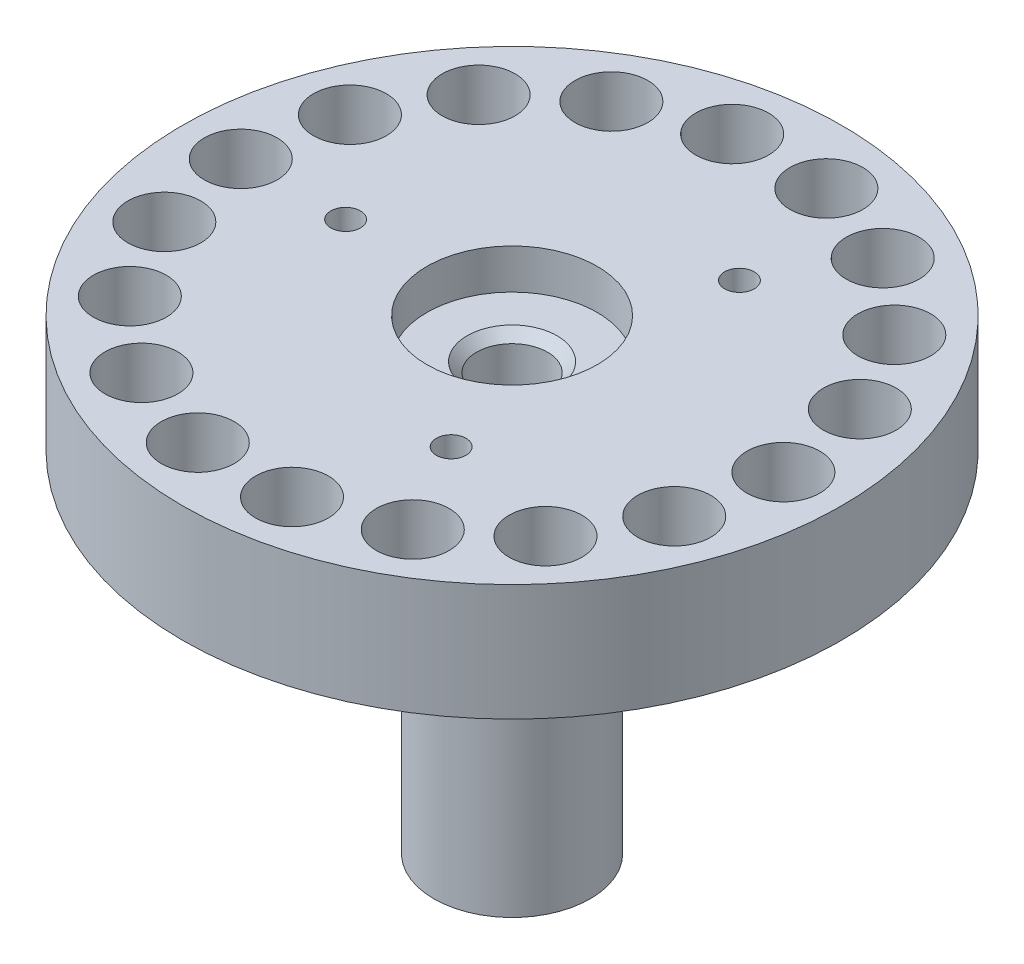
ISO-10303-21;
HEADER;
FILE_DESCRIPTION(('STEP AP214'),'2;1');
FILE_NAME('part.step','',(''),(''),'','','');
FILE_SCHEMA(('AUTOMOTIVE_DESIGN { 1 0 10303 214 1 1 1 1 }'));
ENDSEC;
DATA;
#1=APPLICATION_CONTEXT('core data for automotive mechanical design processes');
#2=APPLICATION_PROTOCOL_DEFINITION('international standard','automotive_design',2000,#1);
#3=PRODUCT_CONTEXT('',#1,'mechanical');
#4=PRODUCT('Part','Part','',(#3));
#5=PRODUCT_RELATED_PRODUCT_CATEGORY('part','',(#4));
#6=PRODUCT_DEFINITION_FORMATION('','',#4);
#7=PRODUCT_DEFINITION_CONTEXT('part definition',#1,'design');
#8=PRODUCT_DEFINITION('design','',#6,#7);
#9=PRODUCT_DEFINITION_SHAPE('','',#8);
#10=(LENGTH_UNIT() NAMED_UNIT(*) SI_UNIT(.MILLI.,.METRE.));
#11=(NAMED_UNIT(*) PLANE_ANGLE_UNIT() SI_UNIT($,.RADIAN.));
#12=(NAMED_UNIT(*) SI_UNIT($,.STERADIAN.) SOLID_ANGLE_UNIT());
#13=UNCERTAINTY_MEASURE_WITH_UNIT(LENGTH_MEASURE(1.E-05),#10,'distance_accuracy_value','');
#14=(GEOMETRIC_REPRESENTATION_CONTEXT(3) GLOBAL_UNCERTAINTY_ASSIGNED_CONTEXT((#13)) GLOBAL_UNIT_ASSIGNED_CONTEXT((#10,
#11,#12)) REPRESENTATION_CONTEXT('',''));
#15=CARTESIAN_POINT('',(0.,0.,0.));
#16=DIRECTION('',(0.,0.,1.));
#17=DIRECTION('',(1.,0.,0.));
#18=AXIS2_PLACEMENT_3D('',#15,#16,#17);
#19=CARTESIAN_POINT('',(0.,-35.56,-5.969));
#20=DIRECTION('',(0.,1.,0.));
#21=DIRECTION('',(0.,0.,1.));
#22=AXIS2_PLACEMENT_3D('',#19,#20,#21);
#23=PLANE('',#22);
#24=CARTESIAN_POINT('',(0.,-35.56,0.));
#25=DIRECTION('',(0.,1.,0.));
#26=DIRECTION('',(0.,0.,1.));
#27=AXIS2_PLACEMENT_3D('',#24,#25,#26);
#28=CIRCLE('',#27,3.42899999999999);
#29=CARTESIAN_POINT('',(0.,-35.56,3.42899999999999));
#30=VERTEX_POINT('',#29);
#31=EDGE_CURVE('E99',#30,#30,#28,.T.);
#32=ORIENTED_EDGE('',*,*,#31,.T.);
#33=EDGE_LOOP('',(#32));
#34=FACE_BOUND('',#33,.T.);
#35=CARTESIAN_POINT('',(0.,-35.56,0.));
#36=DIRECTION('',(0.,1.,0.));
#37=DIRECTION('',(0.,0.,1.));
#38=AXIS2_PLACEMENT_3D('',#35,#36,#37);
#39=CIRCLE('',#38,5.969);
#40=CARTESIAN_POINT('',(0.,-35.56,5.96899999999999));
#41=VERTEX_POINT('',#40);
#42=EDGE_CURVE('E11',#41,#41,#39,.T.);
#43=ORIENTED_EDGE('',*,*,#42,.F.);
#44=EDGE_LOOP('',(#43));
#45=FACE_BOUND('',#44,.T.);
#46=ADVANCED_FACE('F34',(#34,#45),#23,.F.);
#47=CARTESIAN_POINT('',(0.,0.,0.));
#48=DIRECTION('',(0.,1.,0.));
#49=DIRECTION('',(0.,0.,1.));
#50=AXIS2_PLACEMENT_3D('',#47,#48,#49);
#51=CYLINDRICAL_SURFACE('',#50,5.969);
#52=CARTESIAN_POINT('',(0.,-8.89,0.));
#53=DIRECTION('',(0.,1.,0.));
#54=DIRECTION('',(0.,0.,1.));
#55=AXIS2_PLACEMENT_3D('',#52,#53,#54);
#56=CIRCLE('',#55,5.969);
#57=CARTESIAN_POINT('',(0.,-8.89,5.969));
#58=VERTEX_POINT('',#57);
#59=EDGE_CURVE('E42',#58,#58,#56,.T.);
#60=ORIENTED_EDGE('',*,*,#59,.F.);
#61=EDGE_LOOP('',(#60));
#62=FACE_BOUND('',#61,.T.);
#63=ORIENTED_EDGE('',*,*,#42,.T.);
#64=EDGE_LOOP('',(#63));
#65=FACE_BOUND('',#64,.T.);
#66=ADVANCED_FACE('F391',(#62,#65),#51,.T.);
#67=CARTESIAN_POINT('',(0.,-8.89,-8.5852));
#68=DIRECTION('',(0.,1.,0.));
#69=DIRECTION('',(0.,0.,1.));
#70=AXIS2_PLACEMENT_3D('',#67,#68,#69);
#71=PLANE('',#70);
#72=CARTESIAN_POINT('',(0.,-8.89,0.));
#73=DIRECTION('',(0.,1.,0.));
#74=DIRECTION('',(0.,0.,1.));
#75=AXIS2_PLACEMENT_3D('',#72,#73,#74);
#76=CIRCLE('',#75,8.5852);
#77=CARTESIAN_POINT('',(0.,-8.89,8.5852));
#78=VERTEX_POINT('',#77);
#79=EDGE_CURVE('E127',#78,#78,#76,.T.);
#80=ORIENTED_EDGE('',*,*,#79,.F.);
#81=EDGE_LOOP('',(#80));
#82=FACE_BOUND('',#81,.T.);
#83=ORIENTED_EDGE('',*,*,#59,.T.);
#84=EDGE_LOOP('',(#83));
#85=FACE_BOUND('',#84,.T.);
#86=ADVANCED_FACE('F385',(#82,#85),#71,.F.);
#87=CARTESIAN_POINT('',(0.,0.,0.));
#88=DIRECTION('',(0.,1.,0.));
#89=DIRECTION('',(0.,0.,1.));
#90=AXIS2_PLACEMENT_3D('',#87,#88,#89);
#91=CYLINDRICAL_SURFACE('',#90,8.5852);
#92=CARTESIAN_POINT('',(0.,-7.62,0.));
#93=DIRECTION('',(0.,1.,0.));
#94=DIRECTION('',(0.,0.,1.));
#95=AXIS2_PLACEMENT_3D('',#92,#93,#94);
#96=CIRCLE('',#95,8.5852);
#97=CARTESIAN_POINT('',(0.,-7.62,8.5852));
#98=VERTEX_POINT('',#97);
#99=EDGE_CURVE('E124',#98,#98,#96,.T.);
#100=ORIENTED_EDGE('',*,*,#99,.F.);
#101=EDGE_LOOP('',(#100));
#102=FACE_BOUND('',#101,.T.);
#103=ORIENTED_EDGE('',*,*,#79,.T.);
#104=EDGE_LOOP('',(#103));
#105=FACE_BOUND('',#104,.T.);
#106=ADVANCED_FACE('F379',(#102,#105),#91,.T.);
#107=CARTESIAN_POINT('',(0.,-7.62,-10.7188));
#108=DIRECTION('',(0.,1.,0.));
#109=DIRECTION('',(0.,0.,1.));
#110=AXIS2_PLACEMENT_3D('',#107,#108,#109);
#111=PLANE('',#110);
#112=CARTESIAN_POINT('',(0.,-7.62,0.));
#113=DIRECTION('',(0.,1.,0.));
#114=DIRECTION('',(0.,0.,1.));
#115=AXIS2_PLACEMENT_3D('',#112,#113,#114);
#116=CIRCLE('',#115,10.7188);
#117=CARTESIAN_POINT('',(0.,-7.62,10.7188));
#118=VERTEX_POINT('',#117);
#119=EDGE_CURVE('E121',#118,#118,#116,.T.);
#120=ORIENTED_EDGE('',*,*,#119,.F.);
#121=EDGE_LOOP('',(#120));
#122=FACE_BOUND('',#121,.T.);
#123=ORIENTED_EDGE('',*,*,#99,.T.);
#124=EDGE_LOOP('',(#123));
#125=FACE_BOUND('',#124,.T.);
#126=ADVANCED_FACE('F373',(#122,#125),#111,.F.);
#127=CARTESIAN_POINT('',(0.,0.,0.));
#128=DIRECTION('',(0.,1.,0.));
#129=DIRECTION('',(0.,0.,1.));
#130=AXIS2_PLACEMENT_3D('',#127,#128,#129);
#131=CYLINDRICAL_SURFACE('',#130,10.7188);
#132=CARTESIAN_POINT('',(0.,-8.89,0.));
#133=DIRECTION('',(0.,1.,0.));
#134=DIRECTION('',(0.,0.,1.));
#135=AXIS2_PLACEMENT_3D('',#132,#133,#134);
#136=CIRCLE('',#135,10.7188);
#137=CARTESIAN_POINT('',(0.,-8.89,10.7188));
#138=VERTEX_POINT('',#137);
#139=EDGE_CURVE('E118',#138,#138,#136,.T.);
#140=ORIENTED_EDGE('',*,*,#139,.F.);
#141=EDGE_LOOP('',(#140));
#142=FACE_BOUND('',#141,.T.);
#143=ORIENTED_EDGE('',*,*,#119,.T.);
#144=EDGE_LOOP('',(#143));
#145=FACE_BOUND('',#144,.T.);
#146=ADVANCED_FACE('F366',(#142,#145),#131,.F.);
#147=CARTESIAN_POINT('',(0.,-8.89,-25.146));
#148=DIRECTION('',(0.,1.,0.));
#149=DIRECTION('',(0.,0.,1.));
#150=AXIS2_PLACEMENT_3D('',#147,#148,#149);
#151=PLANE('',#150);
#152=CARTESIAN_POINT('',(-3.59469092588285,-8.89,20.3865052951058));
#153=DIRECTION('',(0.,1.,0.));
#154=DIRECTION('',(0.,0.,1.));
#155=AXIS2_PLACEMENT_3D('',#152,#153,#154);
#156=CIRCLE('',#155,1.7272);
#157=CARTESIAN_POINT('',(-3.59469092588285,-8.89,22.1137052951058));
#158=VERTEX_POINT('',#157);
#159=EDGE_CURVE('E37',#158,#158,#156,.T.);
#160=ORIENTED_EDGE('',*,*,#159,.T.);
#161=EDGE_LOOP('',(#160));
#162=FACE_BOUND('',#161,.T.);
#163=CARTESIAN_POINT('',(-10.3504999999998,-8.89,17.9275918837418));
#164=DIRECTION('',(0.,1.,0.));
#165=DIRECTION('',(0.,0.,1.));
#166=AXIS2_PLACEMENT_3D('',#163,#164,#165);
#167=CIRCLE('',#166,1.7272);
#168=CARTESIAN_POINT('',(-10.3504999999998,-8.89,19.6547918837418));
#169=VERTEX_POINT('',#168);
#170=EDGE_CURVE('E210',#169,#169,#167,.T.);
#171=ORIENTED_EDGE('',*,*,#170,.T.);
#172=EDGE_LOOP('',(#171));
#173=FACE_BOUND('',#172,.T.);
#174=CARTESIAN_POINT('',(-15.8578860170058,-8.89,13.3063463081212));
#175=DIRECTION('',(0.,1.,0.));
#176=DIRECTION('',(0.,0.,1.));
#177=AXIS2_PLACEMENT_3D('',#174,#175,#176);
#178=CIRCLE('',#177,1.7272);
#179=CARTESIAN_POINT('',(-15.8578860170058,-8.89,15.0335463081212));
#180=VERTEX_POINT('',#179);
#181=EDGE_CURVE('E206',#180,#180,#178,.T.);
#182=ORIENTED_EDGE('',*,*,#181,.T.);
#183=EDGE_LOOP('',(#182));
#184=FACE_BOUND('',#183,.T.);
#185=CARTESIAN_POINT('',(-19.452576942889,-8.89,7.08015898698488));
#186=DIRECTION('',(0.,1.,0.));
#187=DIRECTION('',(0.,0.,1.));
#188=AXIS2_PLACEMENT_3D('',#185,#186,#187);
#189=CIRCLE('',#188,1.7272);
#190=CARTESIAN_POINT('',(-19.452576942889,-8.89,8.80735898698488));
#191=VERTEX_POINT('',#190);
#192=EDGE_CURVE('E201',#191,#191,#189,.T.);
#193=ORIENTED_EDGE('',*,*,#192,.T.);
#194=EDGE_LOOP('',(#193));
#195=FACE_BOUND('',#194,.T.);
#196=CARTESIAN_POINT('',(-20.701,-8.89,2.20965086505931E-13));
#197=DIRECTION('',(0.,1.,0.));
#198=DIRECTION('',(0.,0.,1.));
#199=AXIS2_PLACEMENT_3D('',#196,#197,#198);
#200=CIRCLE('',#199,1.7272);
#201=CARTESIAN_POINT('',(-20.701,-8.89,1.72720000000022));
#202=VERTEX_POINT('',#201);
#203=EDGE_CURVE('E196',#202,#202,#200,.T.);
#204=ORIENTED_EDGE('',*,*,#203,.T.);
#205=EDGE_LOOP('',(#204));
#206=FACE_BOUND('',#205,.T.);
#207=CARTESIAN_POINT('',(-19.4525769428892,-8.89,-7.08015898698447));
#208=DIRECTION('',(0.,1.,0.));
#209=DIRECTION('',(0.,0.,1.));
#210=AXIS2_PLACEMENT_3D('',#207,#208,#209);
#211=CIRCLE('',#210,1.7272);
#212=CARTESIAN_POINT('',(-19.4525769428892,-8.89,-5.35295898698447));
#213=VERTEX_POINT('',#212);
#214=EDGE_CURVE('E191',#213,#213,#211,.T.);
#215=ORIENTED_EDGE('',*,*,#214,.T.);
#216=EDGE_LOOP('',(#215));
#217=FACE_BOUND('',#216,.T.);
#218=CARTESIAN_POINT('',(-15.8578860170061,-8.89,-13.3063463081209));
#219=DIRECTION('',(0.,1.,0.));
#220=DIRECTION('',(0.,0.,1.));
#221=AXIS2_PLACEMENT_3D('',#218,#219,#220);
#222=CIRCLE('',#221,1.7272);
#223=CARTESIAN_POINT('',(-15.8578860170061,-8.89,-11.5791463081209));
#224=VERTEX_POINT('',#223);
#225=EDGE_CURVE('E186',#224,#224,#222,.T.);
#226=ORIENTED_EDGE('',*,*,#225,.T.);
#227=EDGE_LOOP('',(#226));
#228=FACE_BOUND('',#227,.T.);
#229=CARTESIAN_POINT('',(-10.3505000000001,-8.89,-17.9275918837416));
#230=DIRECTION('',(0.,1.,0.));
#231=DIRECTION('',(0.,0.,1.));
#232=AXIS2_PLACEMENT_3D('',#229,#230,#231);
#233=CIRCLE('',#232,1.7272);
#234=CARTESIAN_POINT('',(-10.3505000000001,-8.89,-16.2003918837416));
#235=VERTEX_POINT('',#234);
#236=EDGE_CURVE('E181',#235,#235,#233,.T.);
#237=ORIENTED_EDGE('',*,*,#236,.T.);
#238=EDGE_LOOP('',(#237));
#239=FACE_BOUND('',#238,.T.);
#240=CARTESIAN_POINT('',(-3.59469092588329,-8.89,-20.3865052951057));
#241=DIRECTION('',(0.,1.,0.));
#242=DIRECTION('',(0.,0.,1.));
#243=AXIS2_PLACEMENT_3D('',#240,#241,#242);
#244=CIRCLE('',#243,1.7272);
#245=CARTESIAN_POINT('',(-3.59469092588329,-8.89,-18.6593052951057));
#246=VERTEX_POINT('',#245);
#247=EDGE_CURVE('E176',#246,#246,#244,.T.);
#248=ORIENTED_EDGE('',*,*,#247,.T.);
#249=EDGE_LOOP('',(#248));
#250=FACE_BOUND('',#249,.T.);
#251=CARTESIAN_POINT('',(3.59469092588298,-8.89,-20.3865052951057));
#252=DIRECTION('',(0.,1.,0.));
#253=DIRECTION('',(0.,0.,1.));
#254=AXIS2_PLACEMENT_3D('',#251,#252,#253);
#255=CIRCLE('',#254,1.7272);
#256=CARTESIAN_POINT('',(3.59469092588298,-8.89,-18.6593052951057));
#257=VERTEX_POINT('',#256);
#258=EDGE_CURVE('E171',#257,#257,#255,.T.);
#259=ORIENTED_EDGE('',*,*,#258,.T.);
#260=EDGE_LOOP('',(#259));
#261=FACE_BOUND('',#260,.T.);
#262=CARTESIAN_POINT('',(10.3504999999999,-8.89,-17.9275918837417));
#263=DIRECTION('',(0.,1.,0.));
#264=DIRECTION('',(0.,0.,1.));
#265=AXIS2_PLACEMENT_3D('',#262,#263,#264);
#266=CIRCLE('',#265,1.7272);
#267=CARTESIAN_POINT('',(10.3504999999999,-8.89,-16.2003918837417));
#268=VERTEX_POINT('',#267);
#269=EDGE_CURVE('E166',#268,#268,#266,.T.);
#270=ORIENTED_EDGE('',*,*,#269,.T.);
#271=EDGE_LOOP('',(#270));
#272=FACE_BOUND('',#271,.T.);
#273=CARTESIAN_POINT('',(15.8578860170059,-8.89,-13.3063463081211));
#274=DIRECTION('',(0.,1.,0.));
#275=DIRECTION('',(0.,0.,1.));
#276=AXIS2_PLACEMENT_3D('',#273,#274,#275);
#277=CIRCLE('',#276,1.7272);
#278=CARTESIAN_POINT('',(15.8578860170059,-8.89,-11.5791463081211));
#279=VERTEX_POINT('',#278);
#280=EDGE_CURVE('E161',#279,#279,#277,.T.);
#281=ORIENTED_EDGE('',*,*,#280,.T.);
#282=EDGE_LOOP('',(#281));
#283=FACE_BOUND('',#282,.T.);
#284=CARTESIAN_POINT('',(19.4525769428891,-8.89,-7.08015898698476));
#285=DIRECTION('',(0.,1.,0.));
#286=DIRECTION('',(0.,0.,1.));
#287=AXIS2_PLACEMENT_3D('',#284,#285,#286);
#288=CIRCLE('',#287,1.7272);
#289=CARTESIAN_POINT('',(19.4525769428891,-8.89,-5.35295898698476));
#290=VERTEX_POINT('',#289);
#291=EDGE_CURVE('E156',#290,#290,#288,.T.);
#292=ORIENTED_EDGE('',*,*,#291,.T.);
#293=EDGE_LOOP('',(#292));
#294=FACE_BOUND('',#293,.T.);
#295=CARTESIAN_POINT('',(20.701,-8.89,0.));
#296=DIRECTION('',(0.,1.,0.));
#297=DIRECTION('',(0.,0.,1.));
#298=AXIS2_PLACEMENT_3D('',#295,#296,#297);
#299=CIRCLE('',#298,1.7272);
#300=CARTESIAN_POINT('',(20.701,-8.89,1.72719999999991));
#301=VERTEX_POINT('',#300);
#302=EDGE_CURVE('E151',#301,#301,#299,.T.);
#303=ORIENTED_EDGE('',*,*,#302,.T.);
#304=EDGE_LOOP('',(#303));
#305=FACE_BOUND('',#304,.T.);
#306=CARTESIAN_POINT('',(19.4525769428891,-8.89,7.0801589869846));
#307=DIRECTION('',(0.,1.,0.));
#308=DIRECTION('',(0.,0.,1.));
#309=AXIS2_PLACEMENT_3D('',#306,#307,#308);
#310=CIRCLE('',#309,1.7272);
#311=CARTESIAN_POINT('',(19.4525769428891,-8.89,8.8073589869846));
#312=VERTEX_POINT('',#311);
#313=EDGE_CURVE('E146',#312,#312,#310,.T.);
#314=ORIENTED_EDGE('',*,*,#313,.T.);
#315=EDGE_LOOP('',(#314));
#316=FACE_BOUND('',#315,.T.);
#317=CARTESIAN_POINT('',(15.857886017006,-8.89,13.306346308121));
#318=DIRECTION('',(0.,1.,0.));
#319=DIRECTION('',(0.,0.,1.));
#320=AXIS2_PLACEMENT_3D('',#317,#318,#319);
#321=CIRCLE('',#320,1.7272);
#322=CARTESIAN_POINT('',(15.857886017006,-8.89,15.033546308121));
#323=VERTEX_POINT('',#322);
#324=EDGE_CURVE('E141',#323,#323,#321,.T.);
#325=ORIENTED_EDGE('',*,*,#324,.T.);
#326=EDGE_LOOP('',(#325));
#327=FACE_BOUND('',#326,.T.);
#328=CARTESIAN_POINT('',(10.3505,-8.89,17.9275918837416));
#329=DIRECTION('',(0.,1.,0.));
#330=DIRECTION('',(0.,0.,1.));
#331=AXIS2_PLACEMENT_3D('',#328,#329,#330);
#332=CIRCLE('',#331,1.7272);
#333=CARTESIAN_POINT('',(10.3505,-8.89,19.6547918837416));
#334=VERTEX_POINT('',#333);
#335=EDGE_CURVE('E136',#334,#334,#332,.T.);
#336=ORIENTED_EDGE('',*,*,#335,.T.);
#337=EDGE_LOOP('',(#336));
#338=FACE_BOUND('',#337,.T.);
#339=CARTESIAN_POINT('',(3.59469092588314,-8.89,20.3865052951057));
#340=DIRECTION('',(0.,1.,0.));
#341=DIRECTION('',(0.,0.,1.));
#342=AXIS2_PLACEMENT_3D('',#339,#340,#341);
#343=CIRCLE('',#342,1.7272);
#344=CARTESIAN_POINT('',(3.59469092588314,-8.89,22.1137052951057));
#345=VERTEX_POINT('',#344);
#346=EDGE_CURVE('E64',#345,#345,#343,.T.);
#347=ORIENTED_EDGE('',*,*,#346,.T.);
#348=EDGE_LOOP('',(#347));
#349=FACE_BOUND('',#348,.T.);
#350=CARTESIAN_POINT('',(0.,-8.89,0.));
#351=DIRECTION('',(0.,1.,0.));
#352=DIRECTION('',(0.,0.,1.));
#353=AXIS2_PLACEMENT_3D('',#350,#351,#352);
#354=CIRCLE('',#353,25.146);
#355=CARTESIAN_POINT('',(0.,-8.89000000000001,25.146));
#356=VERTEX_POINT('',#355);
#357=EDGE_CURVE('E115',#356,#356,#354,.T.);
#358=ORIENTED_EDGE('',*,*,#357,.F.);
#359=EDGE_LOOP('',(#358));
#360=FACE_BOUND('',#359,.T.);
#361=ORIENTED_EDGE('',*,*,#139,.T.);
#362=EDGE_LOOP('',(#361));
#363=FACE_BOUND('',#362,.T.);
#364=ADVANCED_FACE('F360',(#162,#173,#184,#195,#206,#217,#228,#239,#250,#261,#272,#283,#294,
#305,#316,#327,#338,#349,#360,#363),#151,.F.);
#365=CARTESIAN_POINT('',(0.,0.,0.));
#366=DIRECTION('',(0.,1.,0.));
#367=DIRECTION('',(0.,0.,1.));
#368=AXIS2_PLACEMENT_3D('',#365,#366,#367);
#369=CYLINDRICAL_SURFACE('',#368,25.146);
#370=CARTESIAN_POINT('',(0.,0.,0.));
#371=DIRECTION('',(0.,1.,0.));
#372=DIRECTION('',(0.,0.,1.));
#373=AXIS2_PLACEMENT_3D('',#370,#371,#372);
#374=CIRCLE('',#373,25.146);
#375=CARTESIAN_POINT('',(0.,0.,25.146));
#376=VERTEX_POINT('',#375);
#377=EDGE_CURVE('E112',#376,#376,#374,.T.);
#378=ORIENTED_EDGE('',*,*,#377,.F.);
#379=EDGE_LOOP('',(#378));
#380=FACE_BOUND('',#379,.T.);
#381=ORIENTED_EDGE('',*,*,#357,.T.);
#382=EDGE_LOOP('',(#381));
#383=FACE_BOUND('',#382,.T.);
#384=ADVANCED_FACE('F345',(#380,#383),#369,.T.);
#385=CARTESIAN_POINT('',(0.,0.,-6.5024));
#386=DIRECTION('',(0.,-1.,0.));
#387=DIRECTION('',(0.,0.,-1.));
#388=AXIS2_PLACEMENT_3D('',#385,#386,#387);
#389=PLANE('',#388);
#390=CARTESIAN_POINT('',(-3.59469092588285,0.,20.3865052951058));
#391=DIRECTION('',(0.,1.,0.));
#392=DIRECTION('',(0.,0.,1.));
#393=AXIS2_PLACEMENT_3D('',#390,#391,#392);
#394=CIRCLE('',#393,2.7813);
#395=CARTESIAN_POINT('',(-3.59469092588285,0.,23.1678052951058));
#396=VERTEX_POINT('',#395);
#397=EDGE_CURVE('E1173',#396,#396,#394,.T.);
#398=ORIENTED_EDGE('',*,*,#397,.F.);
#399=EDGE_LOOP('',(#398));
#400=FACE_BOUND('',#399,.T.);
#401=CARTESIAN_POINT('',(-10.3504999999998,0.,17.9275918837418));
#402=DIRECTION('',(0.,1.,0.));
#403=DIRECTION('',(0.,0.,1.));
#404=AXIS2_PLACEMENT_3D('',#401,#402,#403);
#405=CIRCLE('',#404,2.7813);
#406=CARTESIAN_POINT('',(-10.3504999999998,0.,20.7088918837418));
#407=VERTEX_POINT('',#406);
#408=EDGE_CURVE('E213',#407,#407,#405,.T.);
#409=ORIENTED_EDGE('',*,*,#408,.F.);
#410=EDGE_LOOP('',(#409));
#411=FACE_BOUND('',#410,.T.);
#412=CARTESIAN_POINT('',(-15.8578860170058,0.,13.3063463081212));
#413=DIRECTION('',(0.,1.,0.));
#414=DIRECTION('',(0.,0.,1.));
#415=AXIS2_PLACEMENT_3D('',#412,#413,#414);
#416=CIRCLE('',#415,2.7813);
#417=CARTESIAN_POINT('',(-15.8578860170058,0.,16.0876463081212));
#418=VERTEX_POINT('',#417);
#419=EDGE_CURVE('E209',#418,#418,#416,.T.);
#420=ORIENTED_EDGE('',*,*,#419,.F.);
#421=EDGE_LOOP('',(#420));
#422=FACE_BOUND('',#421,.T.);
#423=CARTESIAN_POINT('',(-19.452576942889,0.,7.08015898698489));
#424=DIRECTION('',(0.,1.,0.));
#425=DIRECTION('',(0.,0.,1.));
#426=AXIS2_PLACEMENT_3D('',#423,#424,#425);
#427=CIRCLE('',#426,2.7813);
#428=CARTESIAN_POINT('',(-19.452576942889,0.,9.86145898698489));
#429=VERTEX_POINT('',#428);
#430=EDGE_CURVE('E205',#429,#429,#427,.T.);
#431=ORIENTED_EDGE('',*,*,#430,.F.);
#432=EDGE_LOOP('',(#431));
#433=FACE_BOUND('',#432,.T.);
#434=CARTESIAN_POINT('',(-20.701,0.,2.22044604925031E-13));
#435=DIRECTION('',(0.,1.,0.));
#436=DIRECTION('',(0.,0.,1.));
#437=AXIS2_PLACEMENT_3D('',#434,#435,#436);
#438=CIRCLE('',#437,2.7813);
#439=CARTESIAN_POINT('',(-20.701,0.,2.78130000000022));
#440=VERTEX_POINT('',#439);
#441=EDGE_CURVE('E200',#440,#440,#438,.T.);
#442=ORIENTED_EDGE('',*,*,#441,.F.);
#443=EDGE_LOOP('',(#442));
#444=FACE_BOUND('',#443,.T.);
#445=CARTESIAN_POINT('',(-19.4525769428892,0.,-7.08015898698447));
#446=DIRECTION('',(0.,1.,0.));
#447=DIRECTION('',(0.,0.,1.));
#448=AXIS2_PLACEMENT_3D('',#445,#446,#447);
#449=CIRCLE('',#448,2.7813);
#450=CARTESIAN_POINT('',(-19.4525769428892,0.,-4.29885898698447));
#451=VERTEX_POINT('',#450);
#452=EDGE_CURVE('E195',#451,#451,#449,.T.);
#453=ORIENTED_EDGE('',*,*,#452,.F.);
#454=EDGE_LOOP('',(#453));
#455=FACE_BOUND('',#454,.T.);
#456=CARTESIAN_POINT('',(-15.8578860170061,0.,-13.3063463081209));
#457=DIRECTION('',(0.,1.,0.));
#458=DIRECTION('',(0.,0.,1.));
#459=AXIS2_PLACEMENT_3D('',#456,#457,#458);
#460=CIRCLE('',#459,2.7813);
#461=CARTESIAN_POINT('',(-15.8578860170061,0.,-10.5250463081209));
#462=VERTEX_POINT('',#461);
#463=EDGE_CURVE('E190',#462,#462,#460,.T.);
#464=ORIENTED_EDGE('',*,*,#463,.F.);
#465=EDGE_LOOP('',(#464));
#466=FACE_BOUND('',#465,.T.);
#467=CARTESIAN_POINT('',(-10.3505000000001,0.,-17.9275918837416));
#468=DIRECTION('',(0.,1.,0.));
#469=DIRECTION('',(0.,0.,1.));
#470=AXIS2_PLACEMENT_3D('',#467,#468,#469);
#471=CIRCLE('',#470,2.7813);
#472=CARTESIAN_POINT('',(-10.3505000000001,0.,-15.1462918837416));
#473=VERTEX_POINT('',#472);
#474=EDGE_CURVE('E185',#473,#473,#471,.T.);
#475=ORIENTED_EDGE('',*,*,#474,.F.);
#476=EDGE_LOOP('',(#475));
#477=FACE_BOUND('',#476,.T.);
#478=CARTESIAN_POINT('',(-3.59469092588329,0.,-20.3865052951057));
#479=DIRECTION('',(0.,1.,0.));
#480=DIRECTION('',(0.,0.,1.));
#481=AXIS2_PLACEMENT_3D('',#478,#479,#480);
#482=CIRCLE('',#481,2.7813);
#483=CARTESIAN_POINT('',(-3.59469092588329,0.,-17.6052052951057));
#484=VERTEX_POINT('',#483);
#485=EDGE_CURVE('E180',#484,#484,#482,.T.);
#486=ORIENTED_EDGE('',*,*,#485,.F.);
#487=EDGE_LOOP('',(#486));
#488=FACE_BOUND('',#487,.T.);
#489=CARTESIAN_POINT('',(3.59469092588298,0.,-20.3865052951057));
#490=DIRECTION('',(0.,1.,0.));
#491=DIRECTION('',(0.,0.,1.));
#492=AXIS2_PLACEMENT_3D('',#489,#490,#491);
#493=CIRCLE('',#492,2.7813);
#494=CARTESIAN_POINT('',(3.59469092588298,0.,-17.6052052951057));
#495=VERTEX_POINT('',#494);
#496=EDGE_CURVE('E175',#495,#495,#493,.T.);
#497=ORIENTED_EDGE('',*,*,#496,.F.);
#498=EDGE_LOOP('',(#497));
#499=FACE_BOUND('',#498,.T.);
#500=CARTESIAN_POINT('',(10.3504999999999,0.,-17.9275918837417));
#501=DIRECTION('',(0.,1.,0.));
#502=DIRECTION('',(0.,0.,1.));
#503=AXIS2_PLACEMENT_3D('',#500,#501,#502);
#504=CIRCLE('',#503,2.7813);
#505=CARTESIAN_POINT('',(10.3504999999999,0.,-15.1462918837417));
#506=VERTEX_POINT('',#505);
#507=EDGE_CURVE('E170',#506,#506,#504,.T.);
#508=ORIENTED_EDGE('',*,*,#507,.F.);
#509=EDGE_LOOP('',(#508));
#510=FACE_BOUND('',#509,.T.);
#511=CARTESIAN_POINT('',(15.8578860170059,0.,-13.3063463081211));
#512=DIRECTION('',(0.,1.,0.));
#513=DIRECTION('',(0.,0.,1.));
#514=AXIS2_PLACEMENT_3D('',#511,#512,#513);
#515=CIRCLE('',#514,2.7813);
#516=CARTESIAN_POINT('',(15.8578860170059,0.,-10.5250463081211));
#517=VERTEX_POINT('',#516);
#518=EDGE_CURVE('E165',#517,#517,#515,.T.);
#519=ORIENTED_EDGE('',*,*,#518,.F.);
#520=EDGE_LOOP('',(#519));
#521=FACE_BOUND('',#520,.T.);
#522=CARTESIAN_POINT('',(19.4525769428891,0.,-7.08015898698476));
#523=DIRECTION('',(0.,1.,0.));
#524=DIRECTION('',(0.,0.,1.));
#525=AXIS2_PLACEMENT_3D('',#522,#523,#524);
#526=CIRCLE('',#525,2.7813);
#527=CARTESIAN_POINT('',(19.4525769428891,0.,-4.29885898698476));
#528=VERTEX_POINT('',#527);
#529=EDGE_CURVE('E160',#528,#528,#526,.T.);
#530=ORIENTED_EDGE('',*,*,#529,.F.);
#531=EDGE_LOOP('',(#530));
#532=FACE_BOUND('',#531,.T.);
#533=CARTESIAN_POINT('',(20.701,0.,0.));
#534=DIRECTION('',(0.,1.,0.));
#535=DIRECTION('',(0.,0.,1.));
#536=AXIS2_PLACEMENT_3D('',#533,#534,#535);
#537=CIRCLE('',#536,2.7813);
#538=CARTESIAN_POINT('',(20.701,0.,2.78129999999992));
#539=VERTEX_POINT('',#538);
#540=EDGE_CURVE('E155',#539,#539,#537,.T.);
#541=ORIENTED_EDGE('',*,*,#540,.F.);
#542=EDGE_LOOP('',(#541));
#543=FACE_BOUND('',#542,.T.);
#544=CARTESIAN_POINT('',(19.4525769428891,0.,7.08015898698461));
#545=DIRECTION('',(0.,1.,0.));
#546=DIRECTION('',(0.,0.,1.));
#547=AXIS2_PLACEMENT_3D('',#544,#545,#546);
#548=CIRCLE('',#547,2.7813);
#549=CARTESIAN_POINT('',(19.4525769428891,0.,9.8614589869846));
#550=VERTEX_POINT('',#549);
#551=EDGE_CURVE('E150',#550,#550,#548,.T.);
#552=ORIENTED_EDGE('',*,*,#551,.F.);
#553=EDGE_LOOP('',(#552));
#554=FACE_BOUND('',#553,.T.);
#555=CARTESIAN_POINT('',(15.857886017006,0.,13.306346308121));
#556=DIRECTION('',(0.,1.,0.));
#557=DIRECTION('',(0.,0.,1.));
#558=AXIS2_PLACEMENT_3D('',#555,#556,#557);
#559=CIRCLE('',#558,2.7813);
#560=CARTESIAN_POINT('',(15.857886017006,0.,16.087646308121));
#561=VERTEX_POINT('',#560);
#562=EDGE_CURVE('E145',#561,#561,#559,.T.);
#563=ORIENTED_EDGE('',*,*,#562,.F.);
#564=EDGE_LOOP('',(#563));
#565=FACE_BOUND('',#564,.T.);
#566=CARTESIAN_POINT('',(10.3505,0.,17.9275918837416));
#567=DIRECTION('',(0.,1.,0.));
#568=DIRECTION('',(0.,0.,1.));
#569=AXIS2_PLACEMENT_3D('',#566,#567,#568);
#570=CIRCLE('',#569,2.7813);
#571=CARTESIAN_POINT('',(10.3505,0.,20.7088918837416));
#572=VERTEX_POINT('',#571);
#573=EDGE_CURVE('E140',#572,#572,#570,.T.);
#574=ORIENTED_EDGE('',*,*,#573,.F.);
#575=EDGE_LOOP('',(#574));
#576=FACE_BOUND('',#575,.T.);
#577=CARTESIAN_POINT('',(3.59469092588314,0.,20.3865052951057));
#578=DIRECTION('',(0.,1.,0.));
#579=DIRECTION('',(0.,0.,1.));
#580=AXIS2_PLACEMENT_3D('',#577,#578,#579);
#581=CIRCLE('',#580,2.7813);
#582=CARTESIAN_POINT('',(3.59469092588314,0.,23.1678052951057));
#583=VERTEX_POINT('',#582);
#584=EDGE_CURVE('E70',#583,#583,#581,.T.);
#585=ORIENTED_EDGE('',*,*,#584,.F.);
#586=EDGE_LOOP('',(#585));
#587=FACE_BOUND('',#586,.T.);
#588=CARTESIAN_POINT('',(-12.7,0.,0.));
#589=DIRECTION('',(0.,1.,0.));
#590=DIRECTION('',(0.,0.,1.));
#591=AXIS2_PLACEMENT_3D('',#588,#589,#590);
#592=CIRCLE('',#591,1.13029999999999);
#593=CARTESIAN_POINT('',(-12.7,0.,1.13029999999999));
#594=VERTEX_POINT('',#593);
#595=EDGE_CURVE('E63',#594,#594,#592,.T.);
#596=ORIENTED_EDGE('',*,*,#595,.F.);
#597=EDGE_LOOP('',(#596));
#598=FACE_BOUND('',#597,.T.);
#599=CARTESIAN_POINT('',(6.3499999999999,0.,-10.9985226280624));
#600=DIRECTION('',(0.,1.,0.));
#601=DIRECTION('',(0.,0.,1.));
#602=AXIS2_PLACEMENT_3D('',#599,#600,#601);
#603=CIRCLE('',#602,1.13029999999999);
#604=CARTESIAN_POINT('',(6.3499999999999,0.,-9.86822262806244));
#605=VERTEX_POINT('',#604);
#606=EDGE_CURVE('E77',#605,#605,#603,.T.);
#607=ORIENTED_EDGE('',*,*,#606,.F.);
#608=EDGE_LOOP('',(#607));
#609=FACE_BOUND('',#608,.T.);
#610=CARTESIAN_POINT('',(6.35000000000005,0.,10.9985226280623));
#611=DIRECTION('',(0.,1.,0.));
#612=DIRECTION('',(0.,0.,1.));
#613=AXIS2_PLACEMENT_3D('',#610,#611,#612);
#614=CIRCLE('',#613,1.13029999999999);
#615=CARTESIAN_POINT('',(6.35000000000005,0.,12.1288226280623));
#616=VERTEX_POINT('',#615);
#617=EDGE_CURVE('E83',#616,#616,#614,.T.);
#618=ORIENTED_EDGE('',*,*,#617,.F.);
#619=EDGE_LOOP('',(#618));
#620=FACE_BOUND('',#619,.T.);
#621=CARTESIAN_POINT('',(0.,0.,0.));
#622=DIRECTION('',(0.,1.,0.));
#623=DIRECTION('',(0.,0.,1.));
#624=AXIS2_PLACEMENT_3D('',#621,#622,#623);
#625=CIRCLE('',#624,6.5024);
#626=CARTESIAN_POINT('',(0.,0.,6.5024));
#627=VERTEX_POINT('',#626);
#628=EDGE_CURVE('E109',#627,#627,#625,.T.);
#629=ORIENTED_EDGE('',*,*,#628,.F.);
#630=EDGE_LOOP('',(#629));
#631=FACE_BOUND('',#630,.T.);
#632=ORIENTED_EDGE('',*,*,#377,.T.);
#633=EDGE_LOOP('',(#632));
#634=FACE_BOUND('',#633,.T.);
#635=ADVANCED_FACE('F341',(#400,#411,#422,#433,#444,#455,#466,#477,#488,#499,#510,#521,#532,
#543,#554,#565,#576,#587,#598,#609,#620,#631,#634),#389,.F.);
#636=CARTESIAN_POINT('',(0.,0.,0.));
#637=DIRECTION('',(0.,1.,0.));
#638=DIRECTION('',(0.,0.,1.));
#639=AXIS2_PLACEMENT_3D('',#636,#637,#638);
#640=CYLINDRICAL_SURFACE('',#639,6.5024);
#641=CARTESIAN_POINT('',(0.,-3.048,0.));
#642=DIRECTION('',(0.,1.,0.));
#643=DIRECTION('',(0.,0.,1.));
#644=AXIS2_PLACEMENT_3D('',#641,#642,#643);
#645=CIRCLE('',#644,6.5024);
#646=CARTESIAN_POINT('',(0.,-3.048,6.5024));
#647=VERTEX_POINT('',#646);
#648=EDGE_CURVE('E106',#647,#647,#645,.T.);
#649=ORIENTED_EDGE('',*,*,#648,.F.);
#650=EDGE_LOOP('',(#649));
#651=FACE_BOUND('',#650,.T.);
#652=ORIENTED_EDGE('',*,*,#628,.T.);
#653=EDGE_LOOP('',(#652));
#654=FACE_BOUND('',#653,.T.);
#655=ADVANCED_FACE('F344',(#651,#654),#640,.F.);
#656=CARTESIAN_POINT('',(0.,-3.048,0.));
#657=DIRECTION('',(0.,-1.,0.));
#658=DIRECTION('',(0.,0.,-1.));
#659=AXIS2_PLACEMENT_3D('',#656,#657,#658);
#660=PLANE('',#659);
#661=CARTESIAN_POINT('',(0.,-3.048,0.));
#662=DIRECTION('',(0.,1.,0.));
#663=DIRECTION('',(0.,0.,1.));
#664=AXIS2_PLACEMENT_3D('',#661,#662,#663);
#665=CIRCLE('',#664,3.42899999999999);
#666=CARTESIAN_POINT('',(0.,-3.048,3.429));
#667=VERTEX_POINT('',#666);
#668=EDGE_CURVE('E92',#667,#667,#665,.T.);
#669=ORIENTED_EDGE('',*,*,#668,.F.);
#670=EDGE_LOOP('',(#669));
#671=FACE_BOUND('',#670,.T.);
#672=ORIENTED_EDGE('',*,*,#648,.T.);
#673=EDGE_LOOP('',(#672));
#674=FACE_BOUND('',#673,.T.);
#675=ADVANCED_FACE('F409',(#671,#674),#660,.F.);
#676=CARTESIAN_POINT('',(0.,-34.2493862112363,0.));
#677=DIRECTION('',(0.,-1.,0.));
#678=DIRECTION('',(0.,0.,-1.));
#679=AXIS2_PLACEMENT_3D('',#676,#677,#678);
#680=CONICAL_SURFACE('',#679,2.11838621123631,0.785398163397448);
#681=ORIENTED_EDGE('',*,*,#31,.F.);
#682=EDGE_LOOP('',(#681));
#683=FACE_BOUND('',#682,.T.);
#684=CARTESIAN_POINT('',(0.,-34.8361,0.));
#685=DIRECTION('',(0.,-1.,0.));
#686=DIRECTION('',(0.,0.,-1.));
#687=AXIS2_PLACEMENT_3D('',#684,#685,#686);
#688=CIRCLE('',#687,2.7051);
#689=CARTESIAN_POINT('',(0.,-34.8361,-2.7051));
#690=VERTEX_POINT('',#689);
#691=EDGE_CURVE('E102',#690,#690,#688,.T.);
#692=ORIENTED_EDGE('',*,*,#691,.F.);
#693=EDGE_LOOP('',(#692));
#694=FACE_BOUND('',#693,.T.);
#695=ADVANCED_FACE('F405',(#683,#694),#680,.F.);
#696=CARTESIAN_POINT('',(0.,-26.67,0.));
#697=DIRECTION('',(0.,1.,0.));
#698=DIRECTION('',(0.,0.,1.));
#699=AXIS2_PLACEMENT_3D('',#696,#697,#698);
#700=PLANE('',#699);
#701=CARTESIAN_POINT('',(0.,-26.67,0.));
#702=DIRECTION('',(0.,1.,0.));
#703=DIRECTION('',(0.,0.,1.));
#704=AXIS2_PLACEMENT_3D('',#701,#702,#703);
#705=CIRCLE('',#704,1.0287);
#706=CARTESIAN_POINT('',(0.,-26.67,1.0287));
#707=VERTEX_POINT('',#706);
#708=EDGE_CURVE('E89',#707,#707,#705,.T.);
#709=ORIENTED_EDGE('',*,*,#708,.T.);
#710=EDGE_LOOP('',(#709));
#711=FACE_BOUND('',#710,.T.);
#712=CARTESIAN_POINT('',(0.,-26.67,0.));
#713=DIRECTION('',(0.,-1.,0.));
#714=DIRECTION('',(0.,0.,-1.));
#715=AXIS2_PLACEMENT_3D('',#712,#713,#714);
#716=CIRCLE('',#715,2.7051);
#717=CARTESIAN_POINT('',(0.,-26.67,-2.7051));
#718=VERTEX_POINT('',#717);
#719=EDGE_CURVE('E103',#718,#718,#716,.T.);
#720=ORIENTED_EDGE('',*,*,#719,.T.);
#721=EDGE_LOOP('',(#720));
#722=FACE_BOUND('',#721,.T.);
#723=ADVANCED_FACE('F408',(#711,#722),#700,.F.);
#724=CARTESIAN_POINT('',(0.,-35.56,0.));
#725=DIRECTION('',(0.,-1.,0.));
#726=DIRECTION('',(0.,0.,-1.));
#727=AXIS2_PLACEMENT_3D('',#724,#725,#726);
#728=CYLINDRICAL_SURFACE('',#727,2.7051);
#729=ORIENTED_EDGE('',*,*,#691,.T.);
#730=EDGE_LOOP('',(#729));
#731=FACE_BOUND('',#730,.T.);
#732=ORIENTED_EDGE('',*,*,#719,.F.);
#733=EDGE_LOOP('',(#732));
#734=FACE_BOUND('',#733,.T.);
#735=ADVANCED_FACE('F413',(#731,#734),#728,.F.);
#736=CARTESIAN_POINT('',(0.,-4.35861378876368,0.));
#737=DIRECTION('',(0.,1.,0.));
#738=DIRECTION('',(0.,0.,-1.));
#739=AXIS2_PLACEMENT_3D('',#736,#737,#738);
#740=CONICAL_SURFACE('',#739,2.11838621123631,0.785398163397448);
#741=ORIENTED_EDGE('',*,*,#668,.T.);
#742=EDGE_LOOP('',(#741));
#743=FACE_BOUND('',#742,.T.);
#744=CARTESIAN_POINT('',(0.,-3.7719,0.));
#745=DIRECTION('',(0.,1.,0.));
#746=DIRECTION('',(0.,0.,1.));
#747=AXIS2_PLACEMENT_3D('',#744,#745,#746);
#748=CIRCLE('',#747,2.7051);
#749=CARTESIAN_POINT('',(0.,-3.7719,2.7051));
#750=VERTEX_POINT('',#749);
#751=EDGE_CURVE('E95',#750,#750,#748,.T.);
#752=ORIENTED_EDGE('',*,*,#751,.F.);
#753=EDGE_LOOP('',(#752));
#754=FACE_BOUND('',#753,.T.);
#755=ADVANCED_FACE('F416',(#743,#754),#740,.F.);
#756=CARTESIAN_POINT('',(0.,-11.938,0.));
#757=DIRECTION('',(0.,-1.,0.));
#758=DIRECTION('',(0.,0.,-1.));
#759=AXIS2_PLACEMENT_3D('',#756,#757,#758);
#760=PLANE('',#759);
#761=CARTESIAN_POINT('',(0.,-11.938,0.));
#762=DIRECTION('',(0.,1.,0.));
#763=DIRECTION('',(0.,0.,1.));
#764=AXIS2_PLACEMENT_3D('',#761,#762,#763);
#765=CIRCLE('',#764,1.0287);
#766=CARTESIAN_POINT('',(0.,-11.938,1.0287));
#767=VERTEX_POINT('',#766);
#768=EDGE_CURVE('E86',#767,#767,#765,.T.);
#769=ORIENTED_EDGE('',*,*,#768,.F.);
#770=EDGE_LOOP('',(#769));
#771=FACE_BOUND('',#770,.T.);
#772=CARTESIAN_POINT('',(0.,-11.938,0.));
#773=DIRECTION('',(0.,1.,0.));
#774=DIRECTION('',(0.,0.,1.));
#775=AXIS2_PLACEMENT_3D('',#772,#773,#774);
#776=CIRCLE('',#775,2.7051);
#777=CARTESIAN_POINT('',(0.,-11.938,2.7051));
#778=VERTEX_POINT('',#777);
#779=EDGE_CURVE('E96',#778,#778,#776,.T.);
#780=ORIENTED_EDGE('',*,*,#779,.T.);
#781=EDGE_LOOP('',(#780));
#782=FACE_BOUND('',#781,.T.);
#783=ADVANCED_FACE('F1076',(#771,#782),#760,.F.);
#784=CARTESIAN_POINT('',(0.,-3.048,0.));
#785=DIRECTION('',(0.,1.,0.));
#786=DIRECTION('',(0.,0.,1.));
#787=AXIS2_PLACEMENT_3D('',#784,#785,#786);
#788=CYLINDRICAL_SURFACE('',#787,2.7051);
#789=ORIENTED_EDGE('',*,*,#751,.T.);
#790=EDGE_LOOP('',(#789));
#791=FACE_BOUND('',#790,.T.);
#792=ORIENTED_EDGE('',*,*,#779,.F.);
#793=EDGE_LOOP('',(#792));
#794=FACE_BOUND('',#793,.T.);
#795=ADVANCED_FACE('F1068',(#791,#794),#788,.F.);
#796=CARTESIAN_POINT('',(0.,-35.56,0.));
#797=DIRECTION('',(0.,1.,0.));
#798=DIRECTION('',(0.,0.,1.));
#799=AXIS2_PLACEMENT_3D('',#796,#797,#798);
#800=CYLINDRICAL_SURFACE('',#799,1.0287);
#801=ORIENTED_EDGE('',*,*,#768,.T.);
#802=EDGE_LOOP('',(#801));
#803=FACE_BOUND('',#802,.T.);
#804=ORIENTED_EDGE('',*,*,#708,.F.);
#805=EDGE_LOOP('',(#804));
#806=FACE_BOUND('',#805,.T.);
#807=ADVANCED_FACE('F472',(#803,#806),#800,.F.);
#808=CARTESIAN_POINT('',(6.35000000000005,0.,10.9985226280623));
#809=DIRECTION('',(0.,1.,0.));
#810=DIRECTION('',(0.,0.,1.));
#811=AXIS2_PLACEMENT_3D('',#808,#809,#810);
#812=CYLINDRICAL_SURFACE('',#811,1.13029999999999);
#813=CARTESIAN_POINT('',(6.35000000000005,-5.334,10.9985226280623));
#814=DIRECTION('',(0.,1.,0.));
#815=DIRECTION('',(0.,0.,1.));
#816=AXIS2_PLACEMENT_3D('',#813,#814,#815);
#817=CIRCLE('',#816,1.1303);
#818=CARTESIAN_POINT('',(6.35000000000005,-5.334,12.1288226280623));
#819=VERTEX_POINT('',#818);
#820=EDGE_CURVE('E80',#819,#819,#817,.T.);
#821=ORIENTED_EDGE('',*,*,#820,.F.);
#822=EDGE_LOOP('',(#821));
#823=FACE_BOUND('',#822,.T.);
#824=ORIENTED_EDGE('',*,*,#617,.T.);
#825=EDGE_LOOP('',(#824));
#826=FACE_BOUND('',#825,.T.);
#827=ADVANCED_FACE('F466',(#823,#826),#812,.F.);
#828=CARTESIAN_POINT('',(6.35000000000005,-5.334,10.9985226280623));
#829=DIRECTION('',(0.,1.,0.));
#830=DIRECTION('',(0.,0.,1.));
#831=AXIS2_PLACEMENT_3D('',#828,#829,#830);
#832=CONICAL_SURFACE('',#831,1.1303,1.02974425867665);
#833=CARTESIAN_POINT('',(6.35000000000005,-6.01315275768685,10.9985226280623));
#834=VERTEX_POINT('',#833);
#835=VERTEX_LOOP('',#834);
#836=FACE_BOUND('',#835,.T.);
#837=ORIENTED_EDGE('',*,*,#820,.T.);
#838=EDGE_LOOP('',(#837));
#839=FACE_BOUND('',#838,.T.);
#840=ADVANCED_FACE('F471',(#836,#839),#832,.F.);
#841=CARTESIAN_POINT('',(6.3499999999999,0.,-10.9985226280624));
#842=DIRECTION('',(0.,1.,0.));
#843=DIRECTION('',(0.,0.,1.));
#844=AXIS2_PLACEMENT_3D('',#841,#842,#843);
#845=CYLINDRICAL_SURFACE('',#844,1.13029999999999);
#846=CARTESIAN_POINT('',(6.3499999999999,-5.334,-10.9985226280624));
#847=DIRECTION('',(0.,1.,0.));
#848=DIRECTION('',(0.,0.,1.));
#849=AXIS2_PLACEMENT_3D('',#846,#847,#848);
#850=CIRCLE('',#849,1.1303);
#851=CARTESIAN_POINT('',(6.3499999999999,-5.334,-9.86822262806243));
#852=VERTEX_POINT('',#851);
#853=EDGE_CURVE('E67',#852,#852,#850,.T.);
#854=ORIENTED_EDGE('',*,*,#853,.F.);
#855=EDGE_LOOP('',(#854));
#856=FACE_BOUND('',#855,.T.);
#857=ORIENTED_EDGE('',*,*,#606,.T.);
#858=EDGE_LOOP('',(#857));
#859=FACE_BOUND('',#858,.T.);
#860=ADVANCED_FACE('F482',(#856,#859),#845,.F.);
#861=CARTESIAN_POINT('',(6.3499999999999,-5.334,-10.9985226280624));
#862=DIRECTION('',(0.,1.,0.));
#863=DIRECTION('',(0.,0.,1.));
#864=AXIS2_PLACEMENT_3D('',#861,#862,#863);
#865=CONICAL_SURFACE('',#864,1.1303,1.02974425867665);
#866=CARTESIAN_POINT('',(6.3499999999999,-6.01315275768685,-10.9985226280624));
#867=VERTEX_POINT('',#866);
#868=VERTEX_LOOP('',#867);
#869=FACE_BOUND('',#868,.T.);
#870=ORIENTED_EDGE('',*,*,#853,.T.);
#871=EDGE_LOOP('',(#870));
#872=FACE_BOUND('',#871,.T.);
#873=ADVANCED_FACE('F487',(#869,#872),#865,.F.);
#874=CARTESIAN_POINT('',(-12.7,0.,0.));
#875=DIRECTION('',(0.,1.,0.));
#876=DIRECTION('',(0.,0.,1.));
#877=AXIS2_PLACEMENT_3D('',#874,#875,#876);
#878=CYLINDRICAL_SURFACE('',#877,1.13029999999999);
#879=CARTESIAN_POINT('',(-12.7,-5.334,0.));
#880=DIRECTION('',(0.,1.,0.));
#881=DIRECTION('',(0.,0.,1.));
#882=AXIS2_PLACEMENT_3D('',#879,#880,#881);
#883=CIRCLE('',#882,1.1303);
#884=CARTESIAN_POINT('',(-12.7,-5.334,1.1303));
#885=VERTEX_POINT('',#884);
#886=EDGE_CURVE('E61',#885,#885,#883,.T.);
#887=ORIENTED_EDGE('',*,*,#886,.F.);
#888=EDGE_LOOP('',(#887));
#889=FACE_BOUND('',#888,.T.);
#890=ORIENTED_EDGE('',*,*,#595,.T.);
#891=EDGE_LOOP('',(#890));
#892=FACE_BOUND('',#891,.T.);
#893=ADVANCED_FACE('F57',(#889,#892),#878,.F.);
#894=CARTESIAN_POINT('',(-12.7,-5.334,0.));
#895=DIRECTION('',(0.,1.,0.));
#896=DIRECTION('',(0.,0.,1.));
#897=AXIS2_PLACEMENT_3D('',#894,#895,#896);
#898=CONICAL_SURFACE('',#897,1.1303,1.02974425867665);
#899=CARTESIAN_POINT('',(-12.7,-6.01315275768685,0.));
#900=VERTEX_POINT('',#899);
#901=VERTEX_LOOP('',#900);
#902=FACE_BOUND('',#901,.T.);
#903=ORIENTED_EDGE('',*,*,#886,.T.);
#904=EDGE_LOOP('',(#903));
#905=FACE_BOUND('',#904,.T.);
#906=ADVANCED_FACE('F53',(#902,#905),#898,.F.);
#907=CARTESIAN_POINT('',(3.59469092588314,0.,20.3865052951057));
#908=DIRECTION('',(0.,1.,0.));
#909=DIRECTION('',(0.,0.,1.));
#910=AXIS2_PLACEMENT_3D('',#907,#908,#909);
#911=CYLINDRICAL_SURFACE('',#910,1.7272);
#912=CARTESIAN_POINT('',(3.59469092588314,-5.842,20.3865052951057));
#913=DIRECTION('',(0.,1.,0.));
#914=DIRECTION('',(0.,0.,1.));
#915=AXIS2_PLACEMENT_3D('',#912,#913,#914);
#916=CIRCLE('',#915,1.7272);
#917=CARTESIAN_POINT('',(3.59469092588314,-5.842,22.1137052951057));
#918=VERTEX_POINT('',#917);
#919=EDGE_CURVE('E139',#918,#918,#916,.T.);
#920=ORIENTED_EDGE('',*,*,#919,.T.);
#921=EDGE_LOOP('',(#920));
#922=FACE_BOUND('',#921,.T.);
#923=ORIENTED_EDGE('',*,*,#346,.F.);
#924=EDGE_LOOP('',(#923));
#925=FACE_BOUND('',#924,.T.);
#926=ADVANCED_FACE('F56',(#922,#925),#911,.F.);
#927=CARTESIAN_POINT('',(3.59469092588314,0.,20.3865052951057));
#928=DIRECTION('',(0.,1.,0.));
#929=DIRECTION('',(0.,0.,1.));
#930=AXIS2_PLACEMENT_3D('',#927,#928,#929);
#931=CYLINDRICAL_SURFACE('',#930,2.7813);
#932=CARTESIAN_POINT('',(3.59469092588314,-5.842,20.3865052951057));
#933=DIRECTION('',(0.,1.,0.));
#934=DIRECTION('',(0.,0.,1.));
#935=AXIS2_PLACEMENT_3D('',#932,#933,#934);
#936=CIRCLE('',#935,2.7813);
#937=CARTESIAN_POINT('',(3.59469092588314,-5.842,23.1678052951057));
#938=VERTEX_POINT('',#937);
#939=EDGE_CURVE('E332',#938,#938,#936,.T.);
#940=ORIENTED_EDGE('',*,*,#939,.F.);
#941=EDGE_LOOP('',(#940));
#942=FACE_BOUND('',#941,.T.);
#943=ORIENTED_EDGE('',*,*,#584,.T.);
#944=EDGE_LOOP('',(#943));
#945=FACE_BOUND('',#944,.T.);
#946=ADVANCED_FACE('F339',(#942,#945),#931,.F.);
#947=CARTESIAN_POINT('',(5.32189092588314,-5.842,20.3865052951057));
#948=DIRECTION('',(0.,-1.,0.));
#949=DIRECTION('',(0.,0.,-1.));
#950=AXIS2_PLACEMENT_3D('',#947,#948,#949);
#951=PLANE('',#950);
#952=ORIENTED_EDGE('',*,*,#919,.F.);
#953=EDGE_LOOP('',(#952));
#954=FACE_BOUND('',#953,.T.);
#955=ORIENTED_EDGE('',*,*,#939,.T.);
#956=EDGE_LOOP('',(#955));
#957=FACE_BOUND('',#956,.T.);
#958=ADVANCED_FACE('F518',(#954,#957),#951,.F.);
#959=CARTESIAN_POINT('',(10.3505,0.,17.9275918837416));
#960=DIRECTION('',(0.,1.,0.));
#961=DIRECTION('',(0.,0.,1.));
#962=AXIS2_PLACEMENT_3D('',#959,#960,#961);
#963=CYLINDRICAL_SURFACE('',#962,1.7272);
#964=CARTESIAN_POINT('',(10.3505,-5.842,17.9275918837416));
#965=DIRECTION('',(0.,1.,0.));
#966=DIRECTION('',(0.,0.,1.));
#967=AXIS2_PLACEMENT_3D('',#964,#965,#966);
#968=CIRCLE('',#967,1.7272);
#969=CARTESIAN_POINT('',(10.3505,-5.842,19.6547918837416));
#970=VERTEX_POINT('',#969);
#971=EDGE_CURVE('E144',#970,#970,#968,.T.);
#972=ORIENTED_EDGE('',*,*,#971,.T.);
#973=EDGE_LOOP('',(#972));
#974=FACE_BOUND('',#973,.T.);
#975=ORIENTED_EDGE('',*,*,#335,.F.);
#976=EDGE_LOOP('',(#975));
#977=FACE_BOUND('',#976,.T.);
#978=ADVANCED_FACE('F526',(#974,#977),#963,.F.);
#979=CARTESIAN_POINT('',(10.3505,0.,17.9275918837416));
#980=DIRECTION('',(0.,1.,0.));
#981=DIRECTION('',(0.,0.,1.));
#982=AXIS2_PLACEMENT_3D('',#979,#980,#981);
#983=CYLINDRICAL_SURFACE('',#982,2.7813);
#984=CARTESIAN_POINT('',(10.3505,-5.842,17.9275918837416));
#985=DIRECTION('',(0.,1.,0.));
#986=DIRECTION('',(0.,0.,1.));
#987=AXIS2_PLACEMENT_3D('',#984,#985,#986);
#988=CIRCLE('',#987,2.7813);
#989=CARTESIAN_POINT('',(10.3505,-5.842,20.7088918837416));
#990=VERTEX_POINT('',#989);
#991=EDGE_CURVE('E326',#990,#990,#988,.T.);
#992=ORIENTED_EDGE('',*,*,#991,.F.);
#993=EDGE_LOOP('',(#992));
#994=FACE_BOUND('',#993,.T.);
#995=ORIENTED_EDGE('',*,*,#573,.T.);
#996=EDGE_LOOP('',(#995));
#997=FACE_BOUND('',#996,.T.);
#998=ADVANCED_FACE('F535',(#994,#997),#983,.F.);
#999=CARTESIAN_POINT('',(12.0777,-5.842,17.9275918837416));
#1000=DIRECTION('',(0.,-1.,0.));
#1001=DIRECTION('',(0.,0.,-1.));
#1002=AXIS2_PLACEMENT_3D('',#999,#1000,#1001);
#1003=PLANE('',#1002);
#1004=ORIENTED_EDGE('',*,*,#971,.F.);
#1005=EDGE_LOOP('',(#1004));
#1006=FACE_BOUND('',#1005,.T.);
#1007=ORIENTED_EDGE('',*,*,#991,.T.);
#1008=EDGE_LOOP('',(#1007));
#1009=FACE_BOUND('',#1008,.T.);
#1010=ADVANCED_FACE('F543',(#1006,#1009),#1003,.F.);
#1011=CARTESIAN_POINT('',(15.857886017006,0.,13.306346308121));
#1012=DIRECTION('',(0.,1.,0.));
#1013=DIRECTION('',(0.,0.,1.));
#1014=AXIS2_PLACEMENT_3D('',#1011,#1012,#1013);
#1015=CYLINDRICAL_SURFACE('',#1014,1.7272);
#1016=CARTESIAN_POINT('',(15.857886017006,-5.842,13.306346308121));
#1017=DIRECTION('',(0.,1.,0.));
#1018=DIRECTION('',(0.,0.,1.));
#1019=AXIS2_PLACEMENT_3D('',#1016,#1017,#1018);
#1020=CIRCLE('',#1019,1.7272);
#1021=CARTESIAN_POINT('',(15.857886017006,-5.842,15.033546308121));
#1022=VERTEX_POINT('',#1021);
#1023=EDGE_CURVE('E149',#1022,#1022,#1020,.T.);
#1024=ORIENTED_EDGE('',*,*,#1023,.T.);
#1025=EDGE_LOOP('',(#1024));
#1026=FACE_BOUND('',#1025,.T.);
#1027=ORIENTED_EDGE('',*,*,#324,.F.);
#1028=EDGE_LOOP('',(#1027));
#1029=FACE_BOUND('',#1028,.T.);
#1030=ADVANCED_FACE('F551',(#1026,#1029),#1015,.F.);
#1031=CARTESIAN_POINT('',(15.857886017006,0.,13.306346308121));
#1032=DIRECTION('',(0.,1.,0.));
#1033=DIRECTION('',(0.,0.,1.));
#1034=AXIS2_PLACEMENT_3D('',#1031,#1032,#1033);
#1035=CYLINDRICAL_SURFACE('',#1034,2.7813);
#1036=CARTESIAN_POINT('',(15.857886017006,-5.842,13.306346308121));
#1037=DIRECTION('',(0.,1.,0.));
#1038=DIRECTION('',(0.,0.,1.));
#1039=AXIS2_PLACEMENT_3D('',#1036,#1037,#1038);
#1040=CIRCLE('',#1039,2.7813);
#1041=CARTESIAN_POINT('',(15.857886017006,-5.842,16.087646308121));
#1042=VERTEX_POINT('',#1041);
#1043=EDGE_CURVE('E319',#1042,#1042,#1040,.T.);
#1044=ORIENTED_EDGE('',*,*,#1043,.F.);
#1045=EDGE_LOOP('',(#1044));
#1046=FACE_BOUND('',#1045,.T.);
#1047=ORIENTED_EDGE('',*,*,#562,.T.);
#1048=EDGE_LOOP('',(#1047));
#1049=FACE_BOUND('',#1048,.T.);
#1050=ADVANCED_FACE('F559',(#1046,#1049),#1035,.F.);
#1051=CARTESIAN_POINT('',(17.585086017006,-5.842,13.306346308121));
#1052=DIRECTION('',(0.,-1.,0.));
#1053=DIRECTION('',(0.,0.,-1.));
#1054=AXIS2_PLACEMENT_3D('',#1051,#1052,#1053);
#1055=PLANE('',#1054);
#1056=ORIENTED_EDGE('',*,*,#1023,.F.);
#1057=EDGE_LOOP('',(#1056));
#1058=FACE_BOUND('',#1057,.T.);
#1059=ORIENTED_EDGE('',*,*,#1043,.T.);
#1060=EDGE_LOOP('',(#1059));
#1061=FACE_BOUND('',#1060,.T.);
#1062=ADVANCED_FACE('F567',(#1058,#1061),#1055,.F.);
#1063=CARTESIAN_POINT('',(19.4525769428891,0.,7.08015898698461));
#1064=DIRECTION('',(0.,1.,0.));
#1065=DIRECTION('',(0.,0.,1.));
#1066=AXIS2_PLACEMENT_3D('',#1063,#1064,#1065);
#1067=CYLINDRICAL_SURFACE('',#1066,1.7272);
#1068=CARTESIAN_POINT('',(19.4525769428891,-5.842,7.0801589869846));
#1069=DIRECTION('',(0.,1.,0.));
#1070=DIRECTION('',(0.,0.,1.));
#1071=AXIS2_PLACEMENT_3D('',#1068,#1069,#1070);
#1072=CIRCLE('',#1071,1.7272);
#1073=CARTESIAN_POINT('',(19.4525769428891,-5.842,8.80735898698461));
#1074=VERTEX_POINT('',#1073);
#1075=EDGE_CURVE('E154',#1074,#1074,#1072,.T.);
#1076=ORIENTED_EDGE('',*,*,#1075,.T.);
#1077=EDGE_LOOP('',(#1076));
#1078=FACE_BOUND('',#1077,.T.);
#1079=ORIENTED_EDGE('',*,*,#313,.F.);
#1080=EDGE_LOOP('',(#1079));
#1081=FACE_BOUND('',#1080,.T.);
#1082=ADVANCED_FACE('F575',(#1078,#1081),#1067,.F.);
#1083=CARTESIAN_POINT('',(19.4525769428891,0.,7.08015898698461));
#1084=DIRECTION('',(0.,1.,0.));
#1085=DIRECTION('',(0.,0.,1.));
#1086=AXIS2_PLACEMENT_3D('',#1083,#1084,#1085);
#1087=CYLINDRICAL_SURFACE('',#1086,2.7813);
#1088=CARTESIAN_POINT('',(19.4525769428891,-5.842,7.0801589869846));
#1089=DIRECTION('',(0.,1.,0.));
#1090=DIRECTION('',(0.,0.,1.));
#1091=AXIS2_PLACEMENT_3D('',#1088,#1089,#1090);
#1092=CIRCLE('',#1091,2.7813);
#1093=CARTESIAN_POINT('',(19.4525769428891,-5.842,9.8614589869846));
#1094=VERTEX_POINT('',#1093);
#1095=EDGE_CURVE('E312',#1094,#1094,#1092,.T.);
#1096=ORIENTED_EDGE('',*,*,#1095,.F.);
#1097=EDGE_LOOP('',(#1096));
#1098=FACE_BOUND('',#1097,.T.);
#1099=ORIENTED_EDGE('',*,*,#551,.T.);
#1100=EDGE_LOOP('',(#1099));
#1101=FACE_BOUND('',#1100,.T.);
#1102=ADVANCED_FACE('F583',(#1098,#1101),#1087,.F.);
#1103=CARTESIAN_POINT('',(21.1797769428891,-5.842,7.0801589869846));
#1104=DIRECTION('',(0.,-1.,0.));
#1105=DIRECTION('',(0.,0.,-1.));
#1106=AXIS2_PLACEMENT_3D('',#1103,#1104,#1105);
#1107=PLANE('',#1106);
#1108=ORIENTED_EDGE('',*,*,#1075,.F.);
#1109=EDGE_LOOP('',(#1108));
#1110=FACE_BOUND('',#1109,.T.);
#1111=ORIENTED_EDGE('',*,*,#1095,.T.);
#1112=EDGE_LOOP('',(#1111));
#1113=FACE_BOUND('',#1112,.T.);
#1114=ADVANCED_FACE('F591',(#1110,#1113),#1107,.F.);
#1115=CARTESIAN_POINT('',(20.701,0.,0.));
#1116=DIRECTION('',(0.,1.,0.));
#1117=DIRECTION('',(0.,0.,1.));
#1118=AXIS2_PLACEMENT_3D('',#1115,#1116,#1117);
#1119=CYLINDRICAL_SURFACE('',#1118,1.7272);
#1120=CARTESIAN_POINT('',(20.701,-5.842,0.));
#1121=DIRECTION('',(0.,1.,0.));
#1122=DIRECTION('',(0.,0.,1.));
#1123=AXIS2_PLACEMENT_3D('',#1120,#1121,#1122);
#1124=CIRCLE('',#1123,1.7272);
#1125=CARTESIAN_POINT('',(20.701,-5.842,1.72719999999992));
#1126=VERTEX_POINT('',#1125);
#1127=EDGE_CURVE('E159',#1126,#1126,#1124,.T.);
#1128=ORIENTED_EDGE('',*,*,#1127,.T.);
#1129=EDGE_LOOP('',(#1128));
#1130=FACE_BOUND('',#1129,.T.);
#1131=ORIENTED_EDGE('',*,*,#302,.F.);
#1132=EDGE_LOOP('',(#1131));
#1133=FACE_BOUND('',#1132,.T.);
#1134=ADVANCED_FACE('F599',(#1130,#1133),#1119,.F.);
#1135=CARTESIAN_POINT('',(20.701,0.,0.));
#1136=DIRECTION('',(0.,1.,0.));
#1137=DIRECTION('',(0.,0.,1.));
#1138=AXIS2_PLACEMENT_3D('',#1135,#1136,#1137);
#1139=CYLINDRICAL_SURFACE('',#1138,2.7813);
#1140=CARTESIAN_POINT('',(20.701,-5.842,0.));
#1141=DIRECTION('',(0.,1.,0.));
#1142=DIRECTION('',(0.,0.,1.));
#1143=AXIS2_PLACEMENT_3D('',#1140,#1141,#1142);
#1144=CIRCLE('',#1143,2.7813);
#1145=CARTESIAN_POINT('',(20.701,-5.842,2.78129999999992));
#1146=VERTEX_POINT('',#1145);
#1147=EDGE_CURVE('E305',#1146,#1146,#1144,.T.);
#1148=ORIENTED_EDGE('',*,*,#1147,.F.);
#1149=EDGE_LOOP('',(#1148));
#1150=FACE_BOUND('',#1149,.T.);
#1151=ORIENTED_EDGE('',*,*,#540,.T.);
#1152=EDGE_LOOP('',(#1151));
#1153=FACE_BOUND('',#1152,.T.);
#1154=ADVANCED_FACE('F607',(#1150,#1153),#1139,.F.);
#1155=CARTESIAN_POINT('',(22.4282,-5.842,0.));
#1156=DIRECTION('',(0.,-1.,0.));
#1157=DIRECTION('',(0.,0.,-1.));
#1158=AXIS2_PLACEMENT_3D('',#1155,#1156,#1157);
#1159=PLANE('',#1158);
#1160=ORIENTED_EDGE('',*,*,#1127,.F.);
#1161=EDGE_LOOP('',(#1160));
#1162=FACE_BOUND('',#1161,.T.);
#1163=ORIENTED_EDGE('',*,*,#1147,.T.);
#1164=EDGE_LOOP('',(#1163));
#1165=FACE_BOUND('',#1164,.T.);
#1166=ADVANCED_FACE('F615',(#1162,#1165),#1159,.F.);
#1167=CARTESIAN_POINT('',(19.4525769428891,0.,-7.08015898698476));
#1168=DIRECTION('',(0.,1.,0.));
#1169=DIRECTION('',(0.,0.,1.));
#1170=AXIS2_PLACEMENT_3D('',#1167,#1168,#1169);
#1171=CYLINDRICAL_SURFACE('',#1170,1.7272);
#1172=CARTESIAN_POINT('',(19.4525769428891,-5.842,-7.08015898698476));
#1173=DIRECTION('',(0.,1.,0.));
#1174=DIRECTION('',(0.,0.,1.));
#1175=AXIS2_PLACEMENT_3D('',#1172,#1173,#1174);
#1176=CIRCLE('',#1175,1.7272);
#1177=CARTESIAN_POINT('',(19.4525769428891,-5.842,-5.35295898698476));
#1178=VERTEX_POINT('',#1177);
#1179=EDGE_CURVE('E164',#1178,#1178,#1176,.T.);
#1180=ORIENTED_EDGE('',*,*,#1179,.T.);
#1181=EDGE_LOOP('',(#1180));
#1182=FACE_BOUND('',#1181,.T.);
#1183=ORIENTED_EDGE('',*,*,#291,.F.);
#1184=EDGE_LOOP('',(#1183));
#1185=FACE_BOUND('',#1184,.T.);
#1186=ADVANCED_FACE('F623',(#1182,#1185),#1171,.F.);
#1187=CARTESIAN_POINT('',(19.4525769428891,0.,-7.08015898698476));
#1188=DIRECTION('',(0.,1.,0.));
#1189=DIRECTION('',(0.,0.,1.));
#1190=AXIS2_PLACEMENT_3D('',#1187,#1188,#1189);
#1191=CYLINDRICAL_SURFACE('',#1190,2.7813);
#1192=CARTESIAN_POINT('',(19.4525769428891,-5.842,-7.08015898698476));
#1193=DIRECTION('',(0.,1.,0.));
#1194=DIRECTION('',(0.,0.,1.));
#1195=AXIS2_PLACEMENT_3D('',#1192,#1193,#1194);
#1196=CIRCLE('',#1195,2.7813);
#1197=CARTESIAN_POINT('',(19.4525769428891,-5.842,-4.29885898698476));
#1198=VERTEX_POINT('',#1197);
#1199=EDGE_CURVE('E298',#1198,#1198,#1196,.T.);
#1200=ORIENTED_EDGE('',*,*,#1199,.F.);
#1201=EDGE_LOOP('',(#1200));
#1202=FACE_BOUND('',#1201,.T.);
#1203=ORIENTED_EDGE('',*,*,#529,.T.);
#1204=EDGE_LOOP('',(#1203));
#1205=FACE_BOUND('',#1204,.T.);
#1206=ADVANCED_FACE('F631',(#1202,#1205),#1191,.F.);
#1207=CARTESIAN_POINT('',(21.1797769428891,-5.842,-7.08015898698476));
#1208=DIRECTION('',(0.,-1.,0.));
#1209=DIRECTION('',(0.,0.,-1.));
#1210=AXIS2_PLACEMENT_3D('',#1207,#1208,#1209);
#1211=PLANE('',#1210);
#1212=ORIENTED_EDGE('',*,*,#1179,.F.);
#1213=EDGE_LOOP('',(#1212));
#1214=FACE_BOUND('',#1213,.T.);
#1215=ORIENTED_EDGE('',*,*,#1199,.T.);
#1216=EDGE_LOOP('',(#1215));
#1217=FACE_BOUND('',#1216,.T.);
#1218=ADVANCED_FACE('F639',(#1214,#1217),#1211,.F.);
#1219=CARTESIAN_POINT('',(15.8578860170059,0.,-13.3063463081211));
#1220=DIRECTION('',(0.,1.,0.));
#1221=DIRECTION('',(0.,0.,1.));
#1222=AXIS2_PLACEMENT_3D('',#1219,#1220,#1221);
#1223=CYLINDRICAL_SURFACE('',#1222,1.7272);
#1224=CARTESIAN_POINT('',(15.8578860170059,-5.842,-13.3063463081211));
#1225=DIRECTION('',(0.,1.,0.));
#1226=DIRECTION('',(0.,0.,1.));
#1227=AXIS2_PLACEMENT_3D('',#1224,#1225,#1226);
#1228=CIRCLE('',#1227,1.7272);
#1229=CARTESIAN_POINT('',(15.8578860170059,-5.842,-11.5791463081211));
#1230=VERTEX_POINT('',#1229);
#1231=EDGE_CURVE('E169',#1230,#1230,#1228,.T.);
#1232=ORIENTED_EDGE('',*,*,#1231,.T.);
#1233=EDGE_LOOP('',(#1232));
#1234=FACE_BOUND('',#1233,.T.);
#1235=ORIENTED_EDGE('',*,*,#280,.F.);
#1236=EDGE_LOOP('',(#1235));
#1237=FACE_BOUND('',#1236,.T.);
#1238=ADVANCED_FACE('F647',(#1234,#1237),#1223,.F.);
#1239=CARTESIAN_POINT('',(15.8578860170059,0.,-13.3063463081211));
#1240=DIRECTION('',(0.,1.,0.));
#1241=DIRECTION('',(0.,0.,1.));
#1242=AXIS2_PLACEMENT_3D('',#1239,#1240,#1241);
#1243=CYLINDRICAL_SURFACE('',#1242,2.7813);
#1244=CARTESIAN_POINT('',(15.8578860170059,-5.842,-13.3063463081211));
#1245=DIRECTION('',(0.,1.,0.));
#1246=DIRECTION('',(0.,0.,1.));
#1247=AXIS2_PLACEMENT_3D('',#1244,#1245,#1246);
#1248=CIRCLE('',#1247,2.7813);
#1249=CARTESIAN_POINT('',(15.8578860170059,-5.842,-10.5250463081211));
#1250=VERTEX_POINT('',#1249);
#1251=EDGE_CURVE('E291',#1250,#1250,#1248,.T.);
#1252=ORIENTED_EDGE('',*,*,#1251,.F.);
#1253=EDGE_LOOP('',(#1252));
#1254=FACE_BOUND('',#1253,.T.);
#1255=ORIENTED_EDGE('',*,*,#518,.T.);
#1256=EDGE_LOOP('',(#1255));
#1257=FACE_BOUND('',#1256,.T.);
#1258=ADVANCED_FACE('F655',(#1254,#1257),#1243,.F.);
#1259=CARTESIAN_POINT('',(17.5850860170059,-5.842,-13.3063463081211));
#1260=DIRECTION('',(0.,-1.,0.));
#1261=DIRECTION('',(0.,0.,-1.));
#1262=AXIS2_PLACEMENT_3D('',#1259,#1260,#1261);
#1263=PLANE('',#1262);
#1264=ORIENTED_EDGE('',*,*,#1231,.F.);
#1265=EDGE_LOOP('',(#1264));
#1266=FACE_BOUND('',#1265,.T.);
#1267=ORIENTED_EDGE('',*,*,#1251,.T.);
#1268=EDGE_LOOP('',(#1267));
#1269=FACE_BOUND('',#1268,.T.);
#1270=ADVANCED_FACE('F663',(#1266,#1269),#1263,.F.);
#1271=CARTESIAN_POINT('',(10.3504999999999,0.,-17.9275918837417));
#1272=DIRECTION('',(0.,1.,0.));
#1273=DIRECTION('',(0.,0.,1.));
#1274=AXIS2_PLACEMENT_3D('',#1271,#1272,#1273);
#1275=CYLINDRICAL_SURFACE('',#1274,1.7272);
#1276=CARTESIAN_POINT('',(10.3504999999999,-5.842,-17.9275918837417));
#1277=DIRECTION('',(0.,1.,0.));
#1278=DIRECTION('',(0.,0.,1.));
#1279=AXIS2_PLACEMENT_3D('',#1276,#1277,#1278);
#1280=CIRCLE('',#1279,1.7272);
#1281=CARTESIAN_POINT('',(10.3504999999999,-5.842,-16.2003918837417));
#1282=VERTEX_POINT('',#1281);
#1283=EDGE_CURVE('E174',#1282,#1282,#1280,.T.);
#1284=ORIENTED_EDGE('',*,*,#1283,.T.);
#1285=EDGE_LOOP('',(#1284));
#1286=FACE_BOUND('',#1285,.T.);
#1287=ORIENTED_EDGE('',*,*,#269,.F.);
#1288=EDGE_LOOP('',(#1287));
#1289=FACE_BOUND('',#1288,.T.);
#1290=ADVANCED_FACE('F671',(#1286,#1289),#1275,.F.);
#1291=CARTESIAN_POINT('',(10.3504999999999,0.,-17.9275918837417));
#1292=DIRECTION('',(0.,1.,0.));
#1293=DIRECTION('',(0.,0.,1.));
#1294=AXIS2_PLACEMENT_3D('',#1291,#1292,#1293);
#1295=CYLINDRICAL_SURFACE('',#1294,2.7813);
#1296=CARTESIAN_POINT('',(10.3504999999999,-5.842,-17.9275918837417));
#1297=DIRECTION('',(0.,1.,0.));
#1298=DIRECTION('',(0.,0.,1.));
#1299=AXIS2_PLACEMENT_3D('',#1296,#1297,#1298);
#1300=CIRCLE('',#1299,2.7813);
#1301=CARTESIAN_POINT('',(10.3504999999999,-5.842,-15.1462918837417));
#1302=VERTEX_POINT('',#1301);
#1303=EDGE_CURVE('E284',#1302,#1302,#1300,.T.);
#1304=ORIENTED_EDGE('',*,*,#1303,.F.);
#1305=EDGE_LOOP('',(#1304));
#1306=FACE_BOUND('',#1305,.T.);
#1307=ORIENTED_EDGE('',*,*,#507,.T.);
#1308=EDGE_LOOP('',(#1307));
#1309=FACE_BOUND('',#1308,.T.);
#1310=ADVANCED_FACE('F679',(#1306,#1309),#1295,.F.);
#1311=CARTESIAN_POINT('',(12.0776999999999,-5.842,-17.9275918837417));
#1312=DIRECTION('',(0.,-1.,0.));
#1313=DIRECTION('',(0.,0.,-1.));
#1314=AXIS2_PLACEMENT_3D('',#1311,#1312,#1313);
#1315=PLANE('',#1314);
#1316=ORIENTED_EDGE('',*,*,#1283,.F.);
#1317=EDGE_LOOP('',(#1316));
#1318=FACE_BOUND('',#1317,.T.);
#1319=ORIENTED_EDGE('',*,*,#1303,.T.);
#1320=EDGE_LOOP('',(#1319));
#1321=FACE_BOUND('',#1320,.T.);
#1322=ADVANCED_FACE('F687',(#1318,#1321),#1315,.F.);
#1323=CARTESIAN_POINT('',(3.59469092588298,0.,-20.3865052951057));
#1324=DIRECTION('',(0.,1.,0.));
#1325=DIRECTION('',(0.,0.,1.));
#1326=AXIS2_PLACEMENT_3D('',#1323,#1324,#1325);
#1327=CYLINDRICAL_SURFACE('',#1326,1.7272);
#1328=CARTESIAN_POINT('',(3.59469092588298,-5.842,-20.3865052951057));
#1329=DIRECTION('',(0.,1.,0.));
#1330=DIRECTION('',(0.,0.,1.));
#1331=AXIS2_PLACEMENT_3D('',#1328,#1329,#1330);
#1332=CIRCLE('',#1331,1.7272);
#1333=CARTESIAN_POINT('',(3.59469092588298,-5.842,-18.6593052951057));
#1334=VERTEX_POINT('',#1333);
#1335=EDGE_CURVE('E179',#1334,#1334,#1332,.T.);
#1336=ORIENTED_EDGE('',*,*,#1335,.T.);
#1337=EDGE_LOOP('',(#1336));
#1338=FACE_BOUND('',#1337,.T.);
#1339=ORIENTED_EDGE('',*,*,#258,.F.);
#1340=EDGE_LOOP('',(#1339));
#1341=FACE_BOUND('',#1340,.T.);
#1342=ADVANCED_FACE('F695',(#1338,#1341),#1327,.F.);
#1343=CARTESIAN_POINT('',(3.59469092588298,0.,-20.3865052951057));
#1344=DIRECTION('',(0.,1.,0.));
#1345=DIRECTION('',(0.,0.,1.));
#1346=AXIS2_PLACEMENT_3D('',#1343,#1344,#1345);
#1347=CYLINDRICAL_SURFACE('',#1346,2.7813);
#1348=CARTESIAN_POINT('',(3.59469092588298,-5.842,-20.3865052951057));
#1349=DIRECTION('',(0.,1.,0.));
#1350=DIRECTION('',(0.,0.,1.));
#1351=AXIS2_PLACEMENT_3D('',#1348,#1349,#1350);
#1352=CIRCLE('',#1351,2.7813);
#1353=CARTESIAN_POINT('',(3.59469092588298,-5.842,-17.6052052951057));
#1354=VERTEX_POINT('',#1353);
#1355=EDGE_CURVE('E277',#1354,#1354,#1352,.T.);
#1356=ORIENTED_EDGE('',*,*,#1355,.F.);
#1357=EDGE_LOOP('',(#1356));
#1358=FACE_BOUND('',#1357,.T.);
#1359=ORIENTED_EDGE('',*,*,#496,.T.);
#1360=EDGE_LOOP('',(#1359));
#1361=FACE_BOUND('',#1360,.T.);
#1362=ADVANCED_FACE('F703',(#1358,#1361),#1347,.F.);
#1363=CARTESIAN_POINT('',(5.32189092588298,-5.842,-20.3865052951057));
#1364=DIRECTION('',(0.,-1.,0.));
#1365=DIRECTION('',(0.,0.,-1.));
#1366=AXIS2_PLACEMENT_3D('',#1363,#1364,#1365);
#1367=PLANE('',#1366);
#1368=ORIENTED_EDGE('',*,*,#1335,.F.);
#1369=EDGE_LOOP('',(#1368));
#1370=FACE_BOUND('',#1369,.T.);
#1371=ORIENTED_EDGE('',*,*,#1355,.T.);
#1372=EDGE_LOOP('',(#1371));
#1373=FACE_BOUND('',#1372,.T.);
#1374=ADVANCED_FACE('F711',(#1370,#1373),#1367,.F.);
#1375=CARTESIAN_POINT('',(-3.59469092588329,0.,-20.3865052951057));
#1376=DIRECTION('',(0.,1.,0.));
#1377=DIRECTION('',(0.,0.,1.));
#1378=AXIS2_PLACEMENT_3D('',#1375,#1376,#1377);
#1379=CYLINDRICAL_SURFACE('',#1378,1.7272);
#1380=CARTESIAN_POINT('',(-3.59469092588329,-5.842,-20.3865052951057));
#1381=DIRECTION('',(0.,1.,0.));
#1382=DIRECTION('',(0.,0.,1.));
#1383=AXIS2_PLACEMENT_3D('',#1380,#1381,#1382);
#1384=CIRCLE('',#1383,1.7272);
#1385=CARTESIAN_POINT('',(-3.59469092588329,-5.842,-18.6593052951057));
#1386=VERTEX_POINT('',#1385);
#1387=EDGE_CURVE('E184',#1386,#1386,#1384,.T.);
#1388=ORIENTED_EDGE('',*,*,#1387,.T.);
#1389=EDGE_LOOP('',(#1388));
#1390=FACE_BOUND('',#1389,.T.);
#1391=ORIENTED_EDGE('',*,*,#247,.F.);
#1392=EDGE_LOOP('',(#1391));
#1393=FACE_BOUND('',#1392,.T.);
#1394=ADVANCED_FACE('F719',(#1390,#1393),#1379,.F.);
#1395=CARTESIAN_POINT('',(-3.59469092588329,0.,-20.3865052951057));
#1396=DIRECTION('',(0.,1.,0.));
#1397=DIRECTION('',(0.,0.,1.));
#1398=AXIS2_PLACEMENT_3D('',#1395,#1396,#1397);
#1399=CYLINDRICAL_SURFACE('',#1398,2.7813);
#1400=CARTESIAN_POINT('',(-3.59469092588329,-5.842,-20.3865052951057));
#1401=DIRECTION('',(0.,1.,0.));
#1402=DIRECTION('',(0.,0.,1.));
#1403=AXIS2_PLACEMENT_3D('',#1400,#1401,#1402);
#1404=CIRCLE('',#1403,2.7813);
#1405=CARTESIAN_POINT('',(-3.59469092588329,-5.842,-17.6052052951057));
#1406=VERTEX_POINT('',#1405);
#1407=EDGE_CURVE('E270',#1406,#1406,#1404,.T.);
#1408=ORIENTED_EDGE('',*,*,#1407,.F.);
#1409=EDGE_LOOP('',(#1408));
#1410=FACE_BOUND('',#1409,.T.);
#1411=ORIENTED_EDGE('',*,*,#485,.T.);
#1412=EDGE_LOOP('',(#1411));
#1413=FACE_BOUND('',#1412,.T.);
#1414=ADVANCED_FACE('F727',(#1410,#1413),#1399,.F.);
#1415=CARTESIAN_POINT('',(-1.86749092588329,-5.842,-20.3865052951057));
#1416=DIRECTION('',(0.,-1.,0.));
#1417=DIRECTION('',(0.,0.,-1.));
#1418=AXIS2_PLACEMENT_3D('',#1415,#1416,#1417);
#1419=PLANE('',#1418);
#1420=ORIENTED_EDGE('',*,*,#1387,.F.);
#1421=EDGE_LOOP('',(#1420));
#1422=FACE_BOUND('',#1421,.T.);
#1423=ORIENTED_EDGE('',*,*,#1407,.T.);
#1424=EDGE_LOOP('',(#1423));
#1425=FACE_BOUND('',#1424,.T.);
#1426=ADVANCED_FACE('F735',(#1422,#1425),#1419,.F.);
#1427=CARTESIAN_POINT('',(-10.3505000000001,0.,-17.9275918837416));
#1428=DIRECTION('',(0.,1.,0.));
#1429=DIRECTION('',(0.,0.,1.));
#1430=AXIS2_PLACEMENT_3D('',#1427,#1428,#1429);
#1431=CYLINDRICAL_SURFACE('',#1430,1.7272);
#1432=CARTESIAN_POINT('',(-10.3505000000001,-5.842,-17.9275918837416));
#1433=DIRECTION('',(0.,1.,0.));
#1434=DIRECTION('',(0.,0.,1.));
#1435=AXIS2_PLACEMENT_3D('',#1432,#1433,#1434);
#1436=CIRCLE('',#1435,1.7272);
#1437=CARTESIAN_POINT('',(-10.3505000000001,-5.842,-16.2003918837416));
#1438=VERTEX_POINT('',#1437);
#1439=EDGE_CURVE('E189',#1438,#1438,#1436,.T.);
#1440=ORIENTED_EDGE('',*,*,#1439,.T.);
#1441=EDGE_LOOP('',(#1440));
#1442=FACE_BOUND('',#1441,.T.);
#1443=ORIENTED_EDGE('',*,*,#236,.F.);
#1444=EDGE_LOOP('',(#1443));
#1445=FACE_BOUND('',#1444,.T.);
#1446=ADVANCED_FACE('F743',(#1442,#1445),#1431,.F.);
#1447=CARTESIAN_POINT('',(-10.3505000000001,0.,-17.9275918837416));
#1448=DIRECTION('',(0.,1.,0.));
#1449=DIRECTION('',(0.,0.,1.));
#1450=AXIS2_PLACEMENT_3D('',#1447,#1448,#1449);
#1451=CYLINDRICAL_SURFACE('',#1450,2.7813);
#1452=CARTESIAN_POINT('',(-10.3505000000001,-5.842,-17.9275918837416));
#1453=DIRECTION('',(0.,1.,0.));
#1454=DIRECTION('',(0.,0.,1.));
#1455=AXIS2_PLACEMENT_3D('',#1452,#1453,#1454);
#1456=CIRCLE('',#1455,2.7813);
#1457=CARTESIAN_POINT('',(-10.3505000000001,-5.842,-15.1462918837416));
#1458=VERTEX_POINT('',#1457);
#1459=EDGE_CURVE('E263',#1458,#1458,#1456,.T.);
#1460=ORIENTED_EDGE('',*,*,#1459,.F.);
#1461=EDGE_LOOP('',(#1460));
#1462=FACE_BOUND('',#1461,.T.);
#1463=ORIENTED_EDGE('',*,*,#474,.T.);
#1464=EDGE_LOOP('',(#1463));
#1465=FACE_BOUND('',#1464,.T.);
#1466=ADVANCED_FACE('F751',(#1462,#1465),#1451,.F.);
#1467=CARTESIAN_POINT('',(-8.62330000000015,-5.842,-17.9275918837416));
#1468=DIRECTION('',(0.,-1.,0.));
#1469=DIRECTION('',(0.,0.,-1.));
#1470=AXIS2_PLACEMENT_3D('',#1467,#1468,#1469);
#1471=PLANE('',#1470);
#1472=ORIENTED_EDGE('',*,*,#1439,.F.);
#1473=EDGE_LOOP('',(#1472));
#1474=FACE_BOUND('',#1473,.T.);
#1475=ORIENTED_EDGE('',*,*,#1459,.T.);
#1476=EDGE_LOOP('',(#1475));
#1477=FACE_BOUND('',#1476,.T.);
#1478=ADVANCED_FACE('F759',(#1474,#1477),#1471,.F.);
#1479=CARTESIAN_POINT('',(-15.8578860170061,0.,-13.3063463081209));
#1480=DIRECTION('',(0.,1.,0.));
#1481=DIRECTION('',(0.,0.,1.));
#1482=AXIS2_PLACEMENT_3D('',#1479,#1480,#1481);
#1483=CYLINDRICAL_SURFACE('',#1482,1.7272);
#1484=CARTESIAN_POINT('',(-15.8578860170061,-5.842,-13.3063463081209));
#1485=DIRECTION('',(0.,1.,0.));
#1486=DIRECTION('',(0.,0.,1.));
#1487=AXIS2_PLACEMENT_3D('',#1484,#1485,#1486);
#1488=CIRCLE('',#1487,1.7272);
#1489=CARTESIAN_POINT('',(-15.8578860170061,-5.842,-11.5791463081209));
#1490=VERTEX_POINT('',#1489);
#1491=EDGE_CURVE('E194',#1490,#1490,#1488,.T.);
#1492=ORIENTED_EDGE('',*,*,#1491,.T.);
#1493=EDGE_LOOP('',(#1492));
#1494=FACE_BOUND('',#1493,.T.);
#1495=ORIENTED_EDGE('',*,*,#225,.F.);
#1496=EDGE_LOOP('',(#1495));
#1497=FACE_BOUND('',#1496,.T.);
#1498=ADVANCED_FACE('F767',(#1494,#1497),#1483,.F.);
#1499=CARTESIAN_POINT('',(-15.8578860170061,0.,-13.3063463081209));
#1500=DIRECTION('',(0.,1.,0.));
#1501=DIRECTION('',(0.,0.,1.));
#1502=AXIS2_PLACEMENT_3D('',#1499,#1500,#1501);
#1503=CYLINDRICAL_SURFACE('',#1502,2.7813);
#1504=CARTESIAN_POINT('',(-15.8578860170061,-5.842,-13.3063463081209));
#1505=DIRECTION('',(0.,1.,0.));
#1506=DIRECTION('',(0.,0.,1.));
#1507=AXIS2_PLACEMENT_3D('',#1504,#1505,#1506);
#1508=CIRCLE('',#1507,2.7813);
#1509=CARTESIAN_POINT('',(-15.8578860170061,-5.842,-10.5250463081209));
#1510=VERTEX_POINT('',#1509);
#1511=EDGE_CURVE('E256',#1510,#1510,#1508,.T.);
#1512=ORIENTED_EDGE('',*,*,#1511,.F.);
#1513=EDGE_LOOP('',(#1512));
#1514=FACE_BOUND('',#1513,.T.);
#1515=ORIENTED_EDGE('',*,*,#463,.T.);
#1516=EDGE_LOOP('',(#1515));
#1517=FACE_BOUND('',#1516,.T.);
#1518=ADVANCED_FACE('F775',(#1514,#1517),#1503,.F.);
#1519=CARTESIAN_POINT('',(-14.1306860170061,-5.842,-13.3063463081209));
#1520=DIRECTION('',(0.,-1.,0.));
#1521=DIRECTION('',(0.,0.,-1.));
#1522=AXIS2_PLACEMENT_3D('',#1519,#1520,#1521);
#1523=PLANE('',#1522);
#1524=ORIENTED_EDGE('',*,*,#1491,.F.);
#1525=EDGE_LOOP('',(#1524));
#1526=FACE_BOUND('',#1525,.T.);
#1527=ORIENTED_EDGE('',*,*,#1511,.T.);
#1528=EDGE_LOOP('',(#1527));
#1529=FACE_BOUND('',#1528,.T.);
#1530=ADVANCED_FACE('F783',(#1526,#1529),#1523,.F.);
#1531=CARTESIAN_POINT('',(-19.4525769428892,0.,-7.08015898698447));
#1532=DIRECTION('',(0.,1.,0.));
#1533=DIRECTION('',(0.,0.,1.));
#1534=AXIS2_PLACEMENT_3D('',#1531,#1532,#1533);
#1535=CYLINDRICAL_SURFACE('',#1534,1.7272);
#1536=CARTESIAN_POINT('',(-19.4525769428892,-5.842,-7.08015898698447));
#1537=DIRECTION('',(0.,1.,0.));
#1538=DIRECTION('',(0.,0.,1.));
#1539=AXIS2_PLACEMENT_3D('',#1536,#1537,#1538);
#1540=CIRCLE('',#1539,1.7272);
#1541=CARTESIAN_POINT('',(-19.4525769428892,-5.842,-5.35295898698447));
#1542=VERTEX_POINT('',#1541);
#1543=EDGE_CURVE('E199',#1542,#1542,#1540,.T.);
#1544=ORIENTED_EDGE('',*,*,#1543,.T.);
#1545=EDGE_LOOP('',(#1544));
#1546=FACE_BOUND('',#1545,.T.);
#1547=ORIENTED_EDGE('',*,*,#214,.F.);
#1548=EDGE_LOOP('',(#1547));
#1549=FACE_BOUND('',#1548,.T.);
#1550=ADVANCED_FACE('F791',(#1546,#1549),#1535,.F.);
#1551=CARTESIAN_POINT('',(-19.4525769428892,0.,-7.08015898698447));
#1552=DIRECTION('',(0.,1.,0.));
#1553=DIRECTION('',(0.,0.,1.));
#1554=AXIS2_PLACEMENT_3D('',#1551,#1552,#1553);
#1555=CYLINDRICAL_SURFACE('',#1554,2.7813);
#1556=CARTESIAN_POINT('',(-19.4525769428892,-5.842,-7.08015898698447));
#1557=DIRECTION('',(0.,1.,0.));
#1558=DIRECTION('',(0.,0.,1.));
#1559=AXIS2_PLACEMENT_3D('',#1556,#1557,#1558);
#1560=CIRCLE('',#1559,2.7813);
#1561=CARTESIAN_POINT('',(-19.4525769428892,-5.842,-4.29885898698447));
#1562=VERTEX_POINT('',#1561);
#1563=EDGE_CURVE('E249',#1562,#1562,#1560,.T.);
#1564=ORIENTED_EDGE('',*,*,#1563,.F.);
#1565=EDGE_LOOP('',(#1564));
#1566=FACE_BOUND('',#1565,.T.);
#1567=ORIENTED_EDGE('',*,*,#452,.T.);
#1568=EDGE_LOOP('',(#1567));
#1569=FACE_BOUND('',#1568,.T.);
#1570=ADVANCED_FACE('F799',(#1566,#1569),#1555,.F.);
#1571=CARTESIAN_POINT('',(-17.7253769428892,-5.842,-7.08015898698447));
#1572=DIRECTION('',(0.,-1.,0.));
#1573=DIRECTION('',(0.,0.,-1.));
#1574=AXIS2_PLACEMENT_3D('',#1571,#1572,#1573);
#1575=PLANE('',#1574);
#1576=ORIENTED_EDGE('',*,*,#1543,.F.);
#1577=EDGE_LOOP('',(#1576));
#1578=FACE_BOUND('',#1577,.T.);
#1579=ORIENTED_EDGE('',*,*,#1563,.T.);
#1580=EDGE_LOOP('',(#1579));
#1581=FACE_BOUND('',#1580,.T.);
#1582=ADVANCED_FACE('F807',(#1578,#1581),#1575,.F.);
#1583=CARTESIAN_POINT('',(-20.701,0.,2.22044604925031E-13));
#1584=DIRECTION('',(0.,1.,0.));
#1585=DIRECTION('',(0.,0.,1.));
#1586=AXIS2_PLACEMENT_3D('',#1583,#1584,#1585);
#1587=CYLINDRICAL_SURFACE('',#1586,1.7272);
#1588=CARTESIAN_POINT('',(-20.701,-5.842,2.21335207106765E-13));
#1589=DIRECTION('',(0.,1.,0.));
#1590=DIRECTION('',(0.,0.,1.));
#1591=AXIS2_PLACEMENT_3D('',#1588,#1589,#1590);
#1592=CIRCLE('',#1591,1.7272);
#1593=CARTESIAN_POINT('',(-20.701,-5.842,1.72720000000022));
#1594=VERTEX_POINT('',#1593);
#1595=EDGE_CURVE('E204',#1594,#1594,#1592,.T.);
#1596=ORIENTED_EDGE('',*,*,#1595,.T.);
#1597=EDGE_LOOP('',(#1596));
#1598=FACE_BOUND('',#1597,.T.);
#1599=ORIENTED_EDGE('',*,*,#203,.F.);
#1600=EDGE_LOOP('',(#1599));
#1601=FACE_BOUND('',#1600,.T.);
#1602=ADVANCED_FACE('F815',(#1598,#1601),#1587,.F.);
#1603=CARTESIAN_POINT('',(-20.701,0.,2.22044604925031E-13));
#1604=DIRECTION('',(0.,1.,0.));
#1605=DIRECTION('',(0.,0.,1.));
#1606=AXIS2_PLACEMENT_3D('',#1603,#1604,#1605);
#1607=CYLINDRICAL_SURFACE('',#1606,2.7813);
#1608=CARTESIAN_POINT('',(-20.701,-5.842,2.21335207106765E-13));
#1609=DIRECTION('',(0.,1.,0.));
#1610=DIRECTION('',(0.,0.,1.));
#1611=AXIS2_PLACEMENT_3D('',#1608,#1609,#1610);
#1612=CIRCLE('',#1611,2.7813);
#1613=CARTESIAN_POINT('',(-20.701,-5.842,2.78130000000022));
#1614=VERTEX_POINT('',#1613);
#1615=EDGE_CURVE('E242',#1614,#1614,#1612,.T.);
#1616=ORIENTED_EDGE('',*,*,#1615,.F.);
#1617=EDGE_LOOP('',(#1616));
#1618=FACE_BOUND('',#1617,.T.);
#1619=ORIENTED_EDGE('',*,*,#441,.T.);
#1620=EDGE_LOOP('',(#1619));
#1621=FACE_BOUND('',#1620,.T.);
#1622=ADVANCED_FACE('F823',(#1618,#1621),#1607,.F.);
#1623=CARTESIAN_POINT('',(-18.9738,-5.842,2.21335207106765E-13));
#1624=DIRECTION('',(0.,-1.,0.));
#1625=DIRECTION('',(0.,0.,-1.));
#1626=AXIS2_PLACEMENT_3D('',#1623,#1624,#1625);
#1627=PLANE('',#1626);
#1628=ORIENTED_EDGE('',*,*,#1595,.F.);
#1629=EDGE_LOOP('',(#1628));
#1630=FACE_BOUND('',#1629,.T.);
#1631=ORIENTED_EDGE('',*,*,#1615,.T.);
#1632=EDGE_LOOP('',(#1631));
#1633=FACE_BOUND('',#1632,.T.);
#1634=ADVANCED_FACE('F831',(#1630,#1633),#1627,.F.);
#1635=CARTESIAN_POINT('',(-19.452576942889,0.,7.08015898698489));
#1636=DIRECTION('',(0.,1.,0.));
#1637=DIRECTION('',(0.,0.,1.));
#1638=AXIS2_PLACEMENT_3D('',#1635,#1636,#1637);
#1639=CYLINDRICAL_SURFACE('',#1638,1.7272);
#1640=CARTESIAN_POINT('',(-19.452576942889,-5.842,7.08015898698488));
#1641=DIRECTION('',(0.,1.,0.));
#1642=DIRECTION('',(0.,0.,1.));
#1643=AXIS2_PLACEMENT_3D('',#1640,#1641,#1642);
#1644=CIRCLE('',#1643,1.7272);
#1645=CARTESIAN_POINT('',(-19.452576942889,-5.842,8.80735898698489));
#1646=VERTEX_POINT('',#1645);
#1647=EDGE_CURVE('E208',#1646,#1646,#1644,.T.);
#1648=ORIENTED_EDGE('',*,*,#1647,.T.);
#1649=EDGE_LOOP('',(#1648));
#1650=FACE_BOUND('',#1649,.T.);
#1651=ORIENTED_EDGE('',*,*,#192,.F.);
#1652=EDGE_LOOP('',(#1651));
#1653=FACE_BOUND('',#1652,.T.);
#1654=ADVANCED_FACE('F839',(#1650,#1653),#1639,.F.);
#1655=CARTESIAN_POINT('',(-19.452576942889,0.,7.08015898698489));
#1656=DIRECTION('',(0.,1.,0.));
#1657=DIRECTION('',(0.,0.,1.));
#1658=AXIS2_PLACEMENT_3D('',#1655,#1656,#1657);
#1659=CYLINDRICAL_SURFACE('',#1658,2.7813);
#1660=CARTESIAN_POINT('',(-19.452576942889,-5.842,7.08015898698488));
#1661=DIRECTION('',(0.,1.,0.));
#1662=DIRECTION('',(0.,0.,1.));
#1663=AXIS2_PLACEMENT_3D('',#1660,#1661,#1662);
#1664=CIRCLE('',#1663,2.7813);
#1665=CARTESIAN_POINT('',(-19.452576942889,-5.842,9.86145898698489));
#1666=VERTEX_POINT('',#1665);
#1667=EDGE_CURVE('E235',#1666,#1666,#1664,.T.);
#1668=ORIENTED_EDGE('',*,*,#1667,.F.);
#1669=EDGE_LOOP('',(#1668));
#1670=FACE_BOUND('',#1669,.T.);
#1671=ORIENTED_EDGE('',*,*,#430,.T.);
#1672=EDGE_LOOP('',(#1671));
#1673=FACE_BOUND('',#1672,.T.);
#1674=ADVANCED_FACE('F847',(#1670,#1673),#1659,.F.);
#1675=CARTESIAN_POINT('',(-17.725376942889,-5.842,7.08015898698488));
#1676=DIRECTION('',(0.,-1.,0.));
#1677=DIRECTION('',(0.,0.,-1.));
#1678=AXIS2_PLACEMENT_3D('',#1675,#1676,#1677);
#1679=PLANE('',#1678);
#1680=ORIENTED_EDGE('',*,*,#1647,.F.);
#1681=EDGE_LOOP('',(#1680));
#1682=FACE_BOUND('',#1681,.T.);
#1683=ORIENTED_EDGE('',*,*,#1667,.T.);
#1684=EDGE_LOOP('',(#1683));
#1685=FACE_BOUND('',#1684,.T.);
#1686=ADVANCED_FACE('F855',(#1682,#1685),#1679,.F.);
#1687=CARTESIAN_POINT('',(-15.8578860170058,0.,13.3063463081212));
#1688=DIRECTION('',(0.,1.,0.));
#1689=DIRECTION('',(0.,0.,1.));
#1690=AXIS2_PLACEMENT_3D('',#1687,#1688,#1689);
#1691=CYLINDRICAL_SURFACE('',#1690,1.7272);
#1692=CARTESIAN_POINT('',(-15.8578860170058,-5.842,13.3063463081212));
#1693=DIRECTION('',(0.,1.,0.));
#1694=DIRECTION('',(0.,0.,1.));
#1695=AXIS2_PLACEMENT_3D('',#1692,#1693,#1694);
#1696=CIRCLE('',#1695,1.7272);
#1697=CARTESIAN_POINT('',(-15.8578860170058,-5.842,15.0335463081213));
#1698=VERTEX_POINT('',#1697);
#1699=EDGE_CURVE('E212',#1698,#1698,#1696,.T.);
#1700=ORIENTED_EDGE('',*,*,#1699,.T.);
#1701=EDGE_LOOP('',(#1700));
#1702=FACE_BOUND('',#1701,.T.);
#1703=ORIENTED_EDGE('',*,*,#181,.F.);
#1704=EDGE_LOOP('',(#1703));
#1705=FACE_BOUND('',#1704,.T.);
#1706=ADVANCED_FACE('F863',(#1702,#1705),#1691,.F.);
#1707=CARTESIAN_POINT('',(-15.8578860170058,0.,13.3063463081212));
#1708=DIRECTION('',(0.,1.,0.));
#1709=DIRECTION('',(0.,0.,1.));
#1710=AXIS2_PLACEMENT_3D('',#1707,#1708,#1709);
#1711=CYLINDRICAL_SURFACE('',#1710,2.7813);
#1712=CARTESIAN_POINT('',(-15.8578860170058,-5.842,13.3063463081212));
#1713=DIRECTION('',(0.,1.,0.));
#1714=DIRECTION('',(0.,0.,1.));
#1715=AXIS2_PLACEMENT_3D('',#1712,#1713,#1714);
#1716=CIRCLE('',#1715,2.7813);
#1717=CARTESIAN_POINT('',(-15.8578860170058,-5.842,16.0876463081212));
#1718=VERTEX_POINT('',#1717);
#1719=EDGE_CURVE('E217',#1718,#1718,#1716,.T.);
#1720=ORIENTED_EDGE('',*,*,#1719,.F.);
#1721=EDGE_LOOP('',(#1720));
#1722=FACE_BOUND('',#1721,.T.);
#1723=ORIENTED_EDGE('',*,*,#419,.T.);
#1724=EDGE_LOOP('',(#1723));
#1725=FACE_BOUND('',#1724,.T.);
#1726=ADVANCED_FACE('F871',(#1722,#1725),#1711,.F.);
#1727=CARTESIAN_POINT('',(-14.1306860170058,-5.842,13.3063463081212));
#1728=DIRECTION('',(0.,-1.,0.));
#1729=DIRECTION('',(0.,0.,-1.));
#1730=AXIS2_PLACEMENT_3D('',#1727,#1728,#1729);
#1731=PLANE('',#1730);
#1732=ORIENTED_EDGE('',*,*,#1699,.F.);
#1733=EDGE_LOOP('',(#1732));
#1734=FACE_BOUND('',#1733,.T.);
#1735=ORIENTED_EDGE('',*,*,#1719,.T.);
#1736=EDGE_LOOP('',(#1735));
#1737=FACE_BOUND('',#1736,.T.);
#1738=ADVANCED_FACE('F879',(#1734,#1737),#1731,.F.);
#1739=CARTESIAN_POINT('',(-10.3504999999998,0.,17.9275918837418));
#1740=DIRECTION('',(0.,1.,0.));
#1741=DIRECTION('',(0.,0.,1.));
#1742=AXIS2_PLACEMENT_3D('',#1739,#1740,#1741);
#1743=CYLINDRICAL_SURFACE('',#1742,1.7272);
#1744=CARTESIAN_POINT('',(-10.3504999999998,-5.842,17.9275918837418));
#1745=DIRECTION('',(0.,1.,0.));
#1746=DIRECTION('',(0.,0.,1.));
#1747=AXIS2_PLACEMENT_3D('',#1744,#1745,#1746);
#1748=CIRCLE('',#1747,1.7272);
#1749=CARTESIAN_POINT('',(-10.3504999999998,-5.842,19.6547918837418));
#1750=VERTEX_POINT('',#1749);
#1751=EDGE_CURVE('E225',#1750,#1750,#1748,.T.);
#1752=ORIENTED_EDGE('',*,*,#1751,.T.);
#1753=EDGE_LOOP('',(#1752));
#1754=FACE_BOUND('',#1753,.T.);
#1755=ORIENTED_EDGE('',*,*,#170,.F.);
#1756=EDGE_LOOP('',(#1755));
#1757=FACE_BOUND('',#1756,.T.);
#1758=ADVANCED_FACE('F887',(#1754,#1757),#1743,.F.);
#1759=CARTESIAN_POINT('',(-10.3504999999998,0.,17.9275918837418));
#1760=DIRECTION('',(0.,1.,0.));
#1761=DIRECTION('',(0.,0.,1.));
#1762=AXIS2_PLACEMENT_3D('',#1759,#1760,#1761);
#1763=CYLINDRICAL_SURFACE('',#1762,2.7813);
#1764=CARTESIAN_POINT('',(-10.3504999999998,-5.842,17.9275918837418));
#1765=DIRECTION('',(0.,1.,0.));
#1766=DIRECTION('',(0.,0.,1.));
#1767=AXIS2_PLACEMENT_3D('',#1764,#1765,#1766);
#1768=CIRCLE('',#1767,2.7813);
#1769=CARTESIAN_POINT('',(-10.3504999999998,-5.842,20.7088918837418));
#1770=VERTEX_POINT('',#1769);
#1771=EDGE_CURVE('E220',#1770,#1770,#1768,.T.);
#1772=ORIENTED_EDGE('',*,*,#1771,.F.);
#1773=EDGE_LOOP('',(#1772));
#1774=FACE_BOUND('',#1773,.T.);
#1775=ORIENTED_EDGE('',*,*,#408,.T.);
#1776=EDGE_LOOP('',(#1775));
#1777=FACE_BOUND('',#1776,.T.);
#1778=ADVANCED_FACE('F895',(#1774,#1777),#1763,.F.);
#1779=CARTESIAN_POINT('',(-8.62329999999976,-5.842,17.9275918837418));
#1780=DIRECTION('',(0.,-1.,0.));
#1781=DIRECTION('',(0.,0.,-1.));
#1782=AXIS2_PLACEMENT_3D('',#1779,#1780,#1781);
#1783=PLANE('',#1782);
#1784=ORIENTED_EDGE('',*,*,#1751,.F.);
#1785=EDGE_LOOP('',(#1784));
#1786=FACE_BOUND('',#1785,.T.);
#1787=ORIENTED_EDGE('',*,*,#1771,.T.);
#1788=EDGE_LOOP('',(#1787));
#1789=FACE_BOUND('',#1788,.T.);
#1790=ADVANCED_FACE('F903',(#1786,#1789),#1783,.F.);
#1791=CARTESIAN_POINT('',(-3.59469092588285,0.,20.3865052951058));
#1792=DIRECTION('',(0.,1.,0.));
#1793=DIRECTION('',(0.,0.,1.));
#1794=AXIS2_PLACEMENT_3D('',#1791,#1792,#1793);
#1795=CYLINDRICAL_SURFACE('',#1794,1.7272);
#1796=CARTESIAN_POINT('',(-3.59469092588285,-5.842,20.3865052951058));
#1797=DIRECTION('',(0.,1.,0.));
#1798=DIRECTION('',(0.,0.,1.));
#1799=AXIS2_PLACEMENT_3D('',#1796,#1797,#1798);
#1800=CIRCLE('',#1799,1.7272);
#1801=CARTESIAN_POINT('',(-3.59469092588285,-5.842,22.1137052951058));
#1802=VERTEX_POINT('',#1801);
#1803=EDGE_CURVE('E1169',#1802,#1802,#1800,.T.);
#1804=ORIENTED_EDGE('',*,*,#1803,.T.);
#1805=EDGE_LOOP('',(#1804));
#1806=FACE_BOUND('',#1805,.T.);
#1807=ORIENTED_EDGE('',*,*,#159,.F.);
#1808=EDGE_LOOP('',(#1807));
#1809=FACE_BOUND('',#1808,.T.);
#1810=ADVANCED_FACE('F911',(#1806,#1809),#1795,.F.);
#1811=CARTESIAN_POINT('',(-3.59469092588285,0.,20.3865052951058));
#1812=DIRECTION('',(0.,1.,0.));
#1813=DIRECTION('',(0.,0.,1.));
#1814=AXIS2_PLACEMENT_3D('',#1811,#1812,#1813);
#1815=CYLINDRICAL_SURFACE('',#1814,2.7813);
#1816=CARTESIAN_POINT('',(-3.59469092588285,-5.842,20.3865052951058));
#1817=DIRECTION('',(0.,1.,0.));
#1818=DIRECTION('',(0.,0.,1.));
#1819=AXIS2_PLACEMENT_3D('',#1816,#1817,#1818);
#1820=CIRCLE('',#1819,2.7813);
#1821=CARTESIAN_POINT('',(-3.59469092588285,-5.842,23.1678052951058));
#1822=VERTEX_POINT('',#1821);
#1823=EDGE_CURVE('E1172',#1822,#1822,#1820,.T.);
#1824=ORIENTED_EDGE('',*,*,#1823,.F.);
#1825=EDGE_LOOP('',(#1824));
#1826=FACE_BOUND('',#1825,.T.);
#1827=ORIENTED_EDGE('',*,*,#397,.T.);
#1828=EDGE_LOOP('',(#1827));
#1829=FACE_BOUND('',#1828,.T.);
#1830=ADVANCED_FACE('F919',(#1826,#1829),#1815,.F.);
#1831=CARTESIAN_POINT('',(-1.86749092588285,-5.842,20.3865052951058));
#1832=DIRECTION('',(0.,-1.,0.));
#1833=DIRECTION('',(0.,0.,-1.));
#1834=AXIS2_PLACEMENT_3D('',#1831,#1832,#1833);
#1835=PLANE('',#1834);
#1836=ORIENTED_EDGE('',*,*,#1803,.F.);
#1837=EDGE_LOOP('',(#1836));
#1838=FACE_BOUND('',#1837,.T.);
#1839=ORIENTED_EDGE('',*,*,#1823,.T.);
#1840=EDGE_LOOP('',(#1839));
#1841=FACE_BOUND('',#1840,.T.);
#1842=ADVANCED_FACE('F927',(#1838,#1841),#1835,.F.);
#1843=CLOSED_SHELL('',(#46,#66,#86,#106,#126,#146,#364,#384,#635,#655,#675,#695,#723,#735,#755,
#783,#795,#807,#827,#840,#860,#873,#893,#906,#926,#946,#958,#978,#998,#1010,#1030,#1050,#1062,
#1082,#1102,#1114,#1134,#1154,#1166,#1186,#1206,#1218,#1238,#1258,#1270,#1290,#1310,#1322,#1342,
#1362,#1374,#1394,#1414,#1426,#1446,#1466,#1478,#1498,#1518,#1530,#1550,#1570,#1582,#1602,#1622,
#1634,#1654,#1674,#1686,#1706,#1726,#1738,#1758,#1778,#1790,#1810,#1830,#1842));
#1844=MANIFOLD_SOLID_BREP('B2',#1843);
#1845=ADVANCED_BREP_SHAPE_REPRESENTATION('',(#18,#1844),#14);
#1846=SHAPE_DEFINITION_REPRESENTATION(#9,#1845);
ENDSEC;
END-ISO-10303-21;
